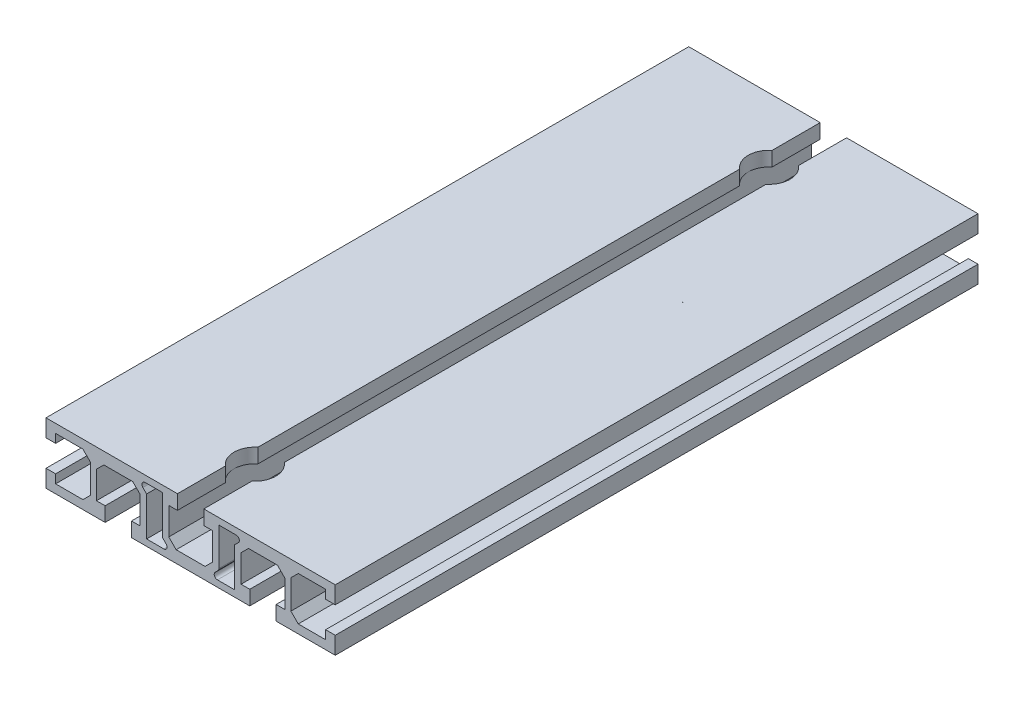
ISO-10303-21;
HEADER;
FILE_DESCRIPTION(('STEP AP214'),'2;1');
FILE_NAME('part.step','',(''),(''),'','','');
FILE_SCHEMA(('AUTOMOTIVE_DESIGN { 1 0 10303 214 1 1 1 1 }'));
ENDSEC;
DATA;
#1=APPLICATION_CONTEXT('core data for automotive mechanical design processes');
#2=APPLICATION_PROTOCOL_DEFINITION('international standard','automotive_design',2000,#1);
#3=PRODUCT_CONTEXT('',#1,'mechanical');
#4=PRODUCT('Part','Part','',(#3));
#5=PRODUCT_RELATED_PRODUCT_CATEGORY('part','',(#4));
#6=PRODUCT_DEFINITION_FORMATION('','',#4);
#7=PRODUCT_DEFINITION_CONTEXT('part definition',#1,'design');
#8=PRODUCT_DEFINITION('design','',#6,#7);
#9=PRODUCT_DEFINITION_SHAPE('','',#8);
#10=(LENGTH_UNIT() NAMED_UNIT(*) SI_UNIT(.MILLI.,.METRE.));
#11=(NAMED_UNIT(*) PLANE_ANGLE_UNIT() SI_UNIT($,.RADIAN.));
#12=(NAMED_UNIT(*) SI_UNIT($,.STERADIAN.) SOLID_ANGLE_UNIT());
#13=UNCERTAINTY_MEASURE_WITH_UNIT(LENGTH_MEASURE(1.E-05),#10,'distance_accuracy_value','');
#14=(GEOMETRIC_REPRESENTATION_CONTEXT(3) GLOBAL_UNCERTAINTY_ASSIGNED_CONTEXT((#13)) GLOBAL_UNIT_ASSIGNED_CONTEXT((#10,
#11,#12)) REPRESENTATION_CONTEXT('',''));
#15=CARTESIAN_POINT('',(0.,0.,0.));
#16=DIRECTION('',(0.,0.,1.));
#17=DIRECTION('',(1.,0.,0.));
#18=AXIS2_PLACEMENT_3D('',#15,#16,#17);
#19=CARTESIAN_POINT('',(-4.09999999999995,4.99999999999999,-100.));
#20=DIRECTION('',(1.,0.,0.));
#21=DIRECTION('',(0.,1.,0.));
#22=AXIS2_PLACEMENT_3D('',#19,#20,#21);
#23=PLANE('',#22);
#24=DIRECTION('',(0.,-1.,0.));
#25=VECTOR('',#24,1.);
#26=CARTESIAN_POINT('',(-4.1000000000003,90.5,85.0438080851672));
#27=LINE('',#26,#25);
#28=CARTESIAN_POINT('',(-4.10000000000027,9.50000000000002,85.0438080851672));
#29=VERTEX_POINT('',#28);
#30=CARTESIAN_POINT('',(-4.09999999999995,4.99999999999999,85.0438080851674));
#31=VERTEX_POINT('',#30);
#32=EDGE_CURVE('E47',#29,#31,#27,.T.);
#33=ORIENTED_EDGE('',*,*,#32,.F.);
#34=DIRECTION('',(0.,0.,1.));
#35=VECTOR('',#34,1.);
#36=CARTESIAN_POINT('',(-4.09999999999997,9.50000000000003,-100.));
#37=LINE('',#36,#35);
#38=CARTESIAN_POINT('',(-4.09999999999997,9.50000000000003,100.));
#39=VERTEX_POINT('',#38);
#40=EDGE_CURVE('E682',#29,#39,#37,.T.);
#41=ORIENTED_EDGE('',*,*,#40,.T.);
#42=DIRECTION('',(0.,1.,0.));
#43=VECTOR('',#42,1.);
#44=CARTESIAN_POINT('',(-4.09999999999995,4.99999999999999,100.));
#45=LINE('',#44,#43);
#46=CARTESIAN_POINT('',(-4.09999999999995,4.99999999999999,100.));
#47=VERTEX_POINT('',#46);
#48=EDGE_CURVE('E751',#47,#39,#45,.T.);
#49=ORIENTED_EDGE('',*,*,#48,.F.);
#50=DIRECTION('',(0.,0.,1.));
#51=VECTOR('',#50,1.);
#52=CARTESIAN_POINT('',(-4.09999999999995,4.99999999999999,-100.));
#53=LINE('',#52,#51);
#54=EDGE_CURVE('E687',#31,#47,#53,.T.);
#55=ORIENTED_EDGE('',*,*,#54,.F.);
#56=EDGE_LOOP('',(#33,#41,#49,#55));
#57=FACE_BOUND('',#56,.T.);
#58=ADVANCED_FACE('F30',(#57),#23,.T.);
#59=CARTESIAN_POINT('',(4.50000000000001,-5.79999999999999,-100.));
#60=DIRECTION('',(0.,1.,0.));
#61=DIRECTION('',(-1.,0.,0.));
#62=AXIS2_PLACEMENT_3D('',#59,#60,#61);
#63=PLANE('',#62);
#64=CARTESIAN_POINT('',(0.,-5.79999999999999,80.));
#65=DIRECTION('',(0.,1.,0.));
#66=DIRECTION('',(-1.,0.,0.));
#67=AXIS2_PLACEMENT_3D('',#64,#65,#66);
#68=CIRCLE('',#67,6.5);
#69=CARTESIAN_POINT('',(-4.50000000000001,-5.79999999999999,84.6904157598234));
#70=VERTEX_POINT('',#69);
#71=CARTESIAN_POINT('',(4.50000000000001,-5.79999999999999,84.6904157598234));
#72=VERTEX_POINT('',#71);
#73=EDGE_CURVE('E55',#70,#72,#68,.T.);
#74=ORIENTED_EDGE('',*,*,#73,.F.);
#75=DIRECTION('',(0.,0.,1.));
#76=VECTOR('',#75,1.);
#77=CARTESIAN_POINT('',(-4.50000000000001,-5.79999999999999,-100.));
#78=LINE('',#77,#76);
#79=CARTESIAN_POINT('',(-4.50000000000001,-5.79999999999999,100.));
#80=VERTEX_POINT('',#79);
#81=EDGE_CURVE('E696',#70,#80,#78,.T.);
#82=ORIENTED_EDGE('',*,*,#81,.T.);
#83=DIRECTION('',(-1.,0.,0.));
#84=VECTOR('',#83,1.);
#85=CARTESIAN_POINT('',(4.50000000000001,-5.79999999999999,100.));
#86=LINE('',#85,#84);
#87=CARTESIAN_POINT('',(4.50000000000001,-5.79999999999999,100.));
#88=VERTEX_POINT('',#87);
#89=EDGE_CURVE('E739',#88,#80,#86,.T.);
#90=ORIENTED_EDGE('',*,*,#89,.F.);
#91=DIRECTION('',(0.,0.,1.));
#92=VECTOR('',#91,1.);
#93=CARTESIAN_POINT('',(4.50000000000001,-5.79999999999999,-100.));
#94=LINE('',#93,#92);
#95=EDGE_CURVE('E701',#72,#88,#94,.T.);
#96=ORIENTED_EDGE('',*,*,#95,.F.);
#97=EDGE_LOOP('',(#74,#82,#90,#96));
#98=FACE_BOUND('',#97,.T.);
#99=ADVANCED_FACE('F1161',(#98),#63,.T.);
#100=CARTESIAN_POINT('',(4.10000000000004,9.5,-100.));
#101=DIRECTION('',(-1.,0.,0.));
#102=DIRECTION('',(0.,-1.,0.));
#103=AXIS2_PLACEMENT_3D('',#100,#101,#102);
#104=PLANE('',#103);
#105=DIRECTION('',(0.,-1.,0.));
#106=VECTOR('',#105,1.);
#107=CARTESIAN_POINT('',(4.10000000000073,90.5,74.9561919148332));
#108=LINE('',#107,#106);
#109=CARTESIAN_POINT('',(4.10000000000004,9.49999999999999,74.9561919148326));
#110=VERTEX_POINT('',#109);
#111=CARTESIAN_POINT('',(4.10000000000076,5.,74.9561919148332));
#112=VERTEX_POINT('',#111);
#113=EDGE_CURVE('E548',#110,#112,#108,.T.);
#114=ORIENTED_EDGE('',*,*,#113,.F.);
#115=DIRECTION('',(0.,0.,1.));
#116=VECTOR('',#115,1.);
#117=CARTESIAN_POINT('',(4.10000000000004,9.5,-100.));
#118=LINE('',#117,#116);
#119=CARTESIAN_POINT('',(4.10000000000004,9.49999999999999,-74.9561919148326));
#120=VERTEX_POINT('',#119);
#121=EDGE_CURVE('E562',#120,#110,#118,.T.);
#122=ORIENTED_EDGE('',*,*,#121,.F.);
#123=DIRECTION('',(0.,-1.,0.));
#124=VECTOR('',#123,1.);
#125=CARTESIAN_POINT('',(4.10000000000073,90.5,-74.9561919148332));
#126=LINE('',#125,#124);
#127=CARTESIAN_POINT('',(4.10000000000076,5.,-74.9561919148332));
#128=VERTEX_POINT('',#127);
#129=EDGE_CURVE('E1190',#128,#120,#126,.F.);
#130=ORIENTED_EDGE('',*,*,#129,.F.);
#131=DIRECTION('',(0.,0.,1.));
#132=VECTOR('',#131,1.);
#133=CARTESIAN_POINT('',(4.1,5.,-100.));
#134=LINE('',#133,#132);
#135=EDGE_CURVE('E564',#128,#112,#134,.T.);
#136=ORIENTED_EDGE('',*,*,#135,.T.);
#137=EDGE_LOOP('',(#114,#122,#130,#136));
#138=FACE_BOUND('',#137,.T.);
#139=ADVANCED_FACE('F560',(#138),#104,.T.);
#140=DIRECTION('',(0.,-1.,0.));
#141=VECTOR('',#140,1.);
#142=CARTESIAN_POINT('',(-4.1000000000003,90.5,74.9561919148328));
#143=LINE('',#142,#141);
#144=CARTESIAN_POINT('',(-4.09999999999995,4.99999999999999,74.9561919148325));
#145=VERTEX_POINT('',#144);
#146=CARTESIAN_POINT('',(-4.10000000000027,9.50000000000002,74.9561919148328));
#147=VERTEX_POINT('',#146);
#148=EDGE_CURVE('E1177',#145,#147,#143,.F.);
#149=ORIENTED_EDGE('',*,*,#148,.F.);
#150=CARTESIAN_POINT('',(-4.09999999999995,4.99999999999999,-74.9561919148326));
#151=VERTEX_POINT('',#150);
#152=EDGE_CURVE('E686',#151,#145,#53,.T.);
#153=ORIENTED_EDGE('',*,*,#152,.F.);
#154=DIRECTION('',(0.,-1.,0.));
#155=VECTOR('',#154,1.);
#156=CARTESIAN_POINT('',(-4.1000000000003,90.5,-74.9561919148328));
#157=LINE('',#156,#155);
#158=CARTESIAN_POINT('',(-4.10000000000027,9.50000000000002,-74.9561919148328));
#159=VERTEX_POINT('',#158);
#160=EDGE_CURVE('E1203',#159,#151,#157,.T.);
#161=ORIENTED_EDGE('',*,*,#160,.F.);
#162=EDGE_CURVE('E681',#159,#147,#37,.T.);
#163=ORIENTED_EDGE('',*,*,#162,.T.);
#164=EDGE_LOOP('',(#149,#153,#161,#163));
#165=FACE_BOUND('',#164,.T.);
#166=ADVANCED_FACE('F1423',(#165),#23,.T.);
#167=CARTESIAN_POINT('',(4.50000000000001,-5.79999999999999,75.3095842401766));
#168=VERTEX_POINT('',#167);
#169=CARTESIAN_POINT('',(-4.50000000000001,-5.79999999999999,75.3095842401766));
#170=VERTEX_POINT('',#169);
#171=EDGE_CURVE('E1169',#168,#170,#68,.T.);
#172=ORIENTED_EDGE('',*,*,#171,.F.);
#173=CARTESIAN_POINT('',(4.50000000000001,-5.79999999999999,-75.3095842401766));
#174=VERTEX_POINT('',#173);
#175=EDGE_CURVE('E700',#174,#168,#94,.T.);
#176=ORIENTED_EDGE('',*,*,#175,.F.);
#177=CARTESIAN_POINT('',(0.,-5.79999999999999,-80.));
#178=DIRECTION('',(0.,1.,0.));
#179=DIRECTION('',(-1.,0.,0.));
#180=AXIS2_PLACEMENT_3D('',#177,#178,#179);
#181=CIRCLE('',#180,6.5);
#182=CARTESIAN_POINT('',(-4.50000000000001,-5.79999999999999,-75.3095842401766));
#183=VERTEX_POINT('',#182);
#184=EDGE_CURVE('E1171',#183,#174,#181,.T.);
#185=ORIENTED_EDGE('',*,*,#184,.F.);
#186=EDGE_CURVE('E695',#183,#170,#78,.T.);
#187=ORIENTED_EDGE('',*,*,#186,.T.);
#188=EDGE_LOOP('',(#172,#176,#185,#187));
#189=FACE_BOUND('',#188,.T.);
#190=ADVANCED_FACE('F1167',(#189),#63,.T.);
#191=DIRECTION('',(0.,-1.,0.));
#192=VECTOR('',#191,1.);
#193=CARTESIAN_POINT('',(4.10000000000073,90.5,-85.0438080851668));
#194=LINE('',#193,#192);
#195=CARTESIAN_POINT('',(4.10000000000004,9.49999999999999,-85.0438080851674));
#196=VERTEX_POINT('',#195);
#197=CARTESIAN_POINT('',(4.10000000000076,5.,-85.0438080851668));
#198=VERTEX_POINT('',#197);
#199=EDGE_CURVE('E1192',#196,#198,#194,.T.);
#200=ORIENTED_EDGE('',*,*,#199,.F.);
#201=CARTESIAN_POINT('',(4.10000000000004,9.5,-100.));
#202=VERTEX_POINT('',#201);
#203=EDGE_CURVE('E571',#202,#196,#118,.T.);
#204=ORIENTED_EDGE('',*,*,#203,.F.);
#205=DIRECTION('',(0.,-1.,0.));
#206=VECTOR('',#205,1.);
#207=CARTESIAN_POINT('',(4.10000000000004,9.5,-100.));
#208=LINE('',#207,#206);
#209=CARTESIAN_POINT('',(4.1,5.,-100.));
#210=VERTEX_POINT('',#209);
#211=EDGE_CURVE('E972',#202,#210,#208,.T.);
#212=ORIENTED_EDGE('',*,*,#211,.T.);
#213=EDGE_CURVE('E578',#210,#198,#134,.T.);
#214=ORIENTED_EDGE('',*,*,#213,.T.);
#215=EDGE_LOOP('',(#200,#204,#212,#214));
#216=FACE_BOUND('',#215,.T.);
#217=ADVANCED_FACE('F1595',(#216),#104,.T.);
#218=CARTESIAN_POINT('',(-18.4,-5.,-100.));
#219=DIRECTION('',(-1.,0.,0.));
#220=DIRECTION('',(0.,-1.,0.));
#221=AXIS2_PLACEMENT_3D('',#218,#219,#220);
#222=PLANE('',#221);
#223=DIRECTION('',(0.,0.,1.));
#224=VECTOR('',#223,1.);
#225=CARTESIAN_POINT('',(-18.4,-9.50000000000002,-100.));
#226=LINE('',#225,#224);
#227=CARTESIAN_POINT('',(-18.4,-9.50000000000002,-100.));
#228=VERTEX_POINT('',#227);
#229=CARTESIAN_POINT('',(-18.4,-9.50000000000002,100.));
#230=VERTEX_POINT('',#229);
#231=EDGE_CURVE('E34',#228,#230,#226,.T.);
#232=ORIENTED_EDGE('',*,*,#231,.T.);
#233=DIRECTION('',(0.,-1.,0.));
#234=VECTOR('',#233,1.);
#235=CARTESIAN_POINT('',(-18.4,-5.,100.));
#236=LINE('',#235,#234);
#237=CARTESIAN_POINT('',(-18.4,-5.,100.));
#238=VERTEX_POINT('',#237);
#239=EDGE_CURVE('E1258',#238,#230,#236,.T.);
#240=ORIENTED_EDGE('',*,*,#239,.F.);
#241=DIRECTION('',(0.,0.,1.));
#242=VECTOR('',#241,1.);
#243=CARTESIAN_POINT('',(-18.4,-5.,-100.));
#244=LINE('',#243,#242);
#245=CARTESIAN_POINT('',(-18.4,-5.,-100.));
#246=VERTEX_POINT('',#245);
#247=EDGE_CURVE('E11',#246,#238,#244,.T.);
#248=ORIENTED_EDGE('',*,*,#247,.F.);
#249=DIRECTION('',(0.,-1.,0.));
#250=VECTOR('',#249,1.);
#251=CARTESIAN_POINT('',(-18.4,-5.,-100.));
#252=LINE('',#251,#250);
#253=EDGE_CURVE('E889',#246,#228,#252,.T.);
#254=ORIENTED_EDGE('',*,*,#253,.T.);
#255=EDGE_LOOP('',(#232,#240,#248,#254));
#256=FACE_BOUND('',#255,.T.);
#257=ADVANCED_FACE('F32',(#256),#222,.T.);
#258=CARTESIAN_POINT('',(-15.7,-5.,-100.));
#259=DIRECTION('',(0.,1.,0.));
#260=DIRECTION('',(-1.,0.,0.));
#261=AXIS2_PLACEMENT_3D('',#258,#259,#260);
#262=PLANE('',#261);
#263=ORIENTED_EDGE('',*,*,#247,.T.);
#264=DIRECTION('',(-1.,0.,0.));
#265=VECTOR('',#264,1.);
#266=CARTESIAN_POINT('',(-15.7,-5.,100.));
#267=LINE('',#266,#265);
#268=CARTESIAN_POINT('',(-15.7,-5.,100.));
#269=VERTEX_POINT('',#268);
#270=EDGE_CURVE('E814',#269,#238,#267,.T.);
#271=ORIENTED_EDGE('',*,*,#270,.F.);
#272=DIRECTION('',(0.,0.,1.));
#273=VECTOR('',#272,1.);
#274=CARTESIAN_POINT('',(-15.7,-5.,-100.));
#275=LINE('',#274,#273);
#276=CARTESIAN_POINT('',(-15.7,-5.,-100.));
#277=VERTEX_POINT('',#276);
#278=EDGE_CURVE('E39',#277,#269,#275,.T.);
#279=ORIENTED_EDGE('',*,*,#278,.F.);
#280=DIRECTION('',(-1.,0.,0.));
#281=VECTOR('',#280,1.);
#282=CARTESIAN_POINT('',(-15.7,-5.,-100.));
#283=LINE('',#282,#281);
#284=EDGE_CURVE('E625',#277,#246,#283,.T.);
#285=ORIENTED_EDGE('',*,*,#284,.T.);
#286=EDGE_LOOP('',(#263,#271,#279,#285));
#287=FACE_BOUND('',#286,.T.);
#288=ADVANCED_FACE('F1480',(#287),#262,.T.);
#289=CARTESIAN_POINT('',(-15.7,3.5,-100.));
#290=DIRECTION('',(-1.,0.,0.));
#291=DIRECTION('',(0.,-1.,0.));
#292=AXIS2_PLACEMENT_3D('',#289,#290,#291);
#293=PLANE('',#292);
#294=ORIENTED_EDGE('',*,*,#278,.T.);
#295=DIRECTION('',(0.,-1.,0.));
#296=VECTOR('',#295,1.);
#297=CARTESIAN_POINT('',(-15.7,3.5,100.));
#298=LINE('',#297,#296);
#299=CARTESIAN_POINT('',(-15.7,3.5,100.));
#300=VERTEX_POINT('',#299);
#301=EDGE_CURVE('E811',#300,#269,#298,.T.);
#302=ORIENTED_EDGE('',*,*,#301,.F.);
#303=DIRECTION('',(0.,0.,1.));
#304=VECTOR('',#303,1.);
#305=CARTESIAN_POINT('',(-15.7,3.5,-100.));
#306=LINE('',#305,#304);
#307=CARTESIAN_POINT('',(-15.7,3.5,-100.));
#308=VERTEX_POINT('',#307);
#309=EDGE_CURVE('E640',#308,#300,#306,.T.);
#310=ORIENTED_EDGE('',*,*,#309,.F.);
#311=DIRECTION('',(0.,-1.,0.));
#312=VECTOR('',#311,1.);
#313=CARTESIAN_POINT('',(-15.7,3.5,-100.));
#314=LINE('',#313,#312);
#315=EDGE_CURVE('E630',#308,#277,#314,.T.);
#316=ORIENTED_EDGE('',*,*,#315,.T.);
#317=EDGE_LOOP('',(#294,#302,#310,#316));
#318=FACE_BOUND('',#317,.T.);
#319=ADVANCED_FACE('F1477',(#318),#293,.T.);
#320=CARTESIAN_POINT('',(-18.,5.79999999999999,-100.));
#321=DIRECTION('',(-0.707106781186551,-0.707106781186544,0.));
#322=DIRECTION('',(0.707106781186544,-0.707106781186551,0.));
#323=AXIS2_PLACEMENT_3D('',#320,#321,#322);
#324=PLANE('',#323);
#325=ORIENTED_EDGE('',*,*,#309,.T.);
#326=DIRECTION('',(0.707106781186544,-0.707106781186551,0.));
#327=VECTOR('',#326,1.);
#328=CARTESIAN_POINT('',(-18.,5.79999999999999,100.));
#329=LINE('',#328,#327);
#330=CARTESIAN_POINT('',(-18.,5.79999999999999,100.));
#331=VERTEX_POINT('',#330);
#332=EDGE_CURVE('E808',#331,#300,#329,.T.);
#333=ORIENTED_EDGE('',*,*,#332,.F.);
#334=DIRECTION('',(0.,0.,1.));
#335=VECTOR('',#334,1.);
#336=CARTESIAN_POINT('',(-18.,5.79999999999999,-100.));
#337=LINE('',#336,#335);
#338=CARTESIAN_POINT('',(-18.,5.79999999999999,-100.));
#339=VERTEX_POINT('',#338);
#340=EDGE_CURVE('E642',#339,#331,#337,.T.);
#341=ORIENTED_EDGE('',*,*,#340,.F.);
#342=DIRECTION('',(0.707106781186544,-0.707106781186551,0.));
#343=VECTOR('',#342,1.);
#344=CARTESIAN_POINT('',(-18.,5.79999999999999,-100.));
#345=LINE('',#344,#343);
#346=EDGE_CURVE('E635',#339,#308,#345,.T.);
#347=ORIENTED_EDGE('',*,*,#346,.T.);
#348=EDGE_LOOP('',(#325,#333,#341,#347));
#349=FACE_BOUND('',#348,.T.);
#350=ADVANCED_FACE('F1053',(#349),#324,.T.);
#351=CARTESIAN_POINT('',(-27.,5.79999999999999,-100.));
#352=DIRECTION('',(0.,-1.,0.));
#353=DIRECTION('',(1.,0.,0.));
#354=AXIS2_PLACEMENT_3D('',#351,#352,#353);
#355=PLANE('',#354);
#356=ORIENTED_EDGE('',*,*,#340,.T.);
#357=DIRECTION('',(1.,0.,0.));
#358=VECTOR('',#357,1.);
#359=CARTESIAN_POINT('',(-27.,5.79999999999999,100.));
#360=LINE('',#359,#358);
#361=CARTESIAN_POINT('',(-27.,5.79999999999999,100.));
#362=VERTEX_POINT('',#361);
#363=EDGE_CURVE('E805',#362,#331,#360,.T.);
#364=ORIENTED_EDGE('',*,*,#363,.F.);
#365=DIRECTION('',(0.,0.,1.));
#366=VECTOR('',#365,1.);
#367=CARTESIAN_POINT('',(-27.,5.79999999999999,-100.));
#368=LINE('',#367,#366);
#369=CARTESIAN_POINT('',(-27.,5.79999999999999,-100.));
#370=VERTEX_POINT('',#369);
#371=EDGE_CURVE('E644',#370,#362,#368,.T.);
#372=ORIENTED_EDGE('',*,*,#371,.F.);
#373=DIRECTION('',(1.,0.,0.));
#374=VECTOR('',#373,1.);
#375=CARTESIAN_POINT('',(-27.,5.79999999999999,-100.));
#376=LINE('',#375,#374);
#377=EDGE_CURVE('E1048',#370,#339,#376,.T.);
#378=ORIENTED_EDGE('',*,*,#377,.T.);
#379=EDGE_LOOP('',(#356,#364,#372,#378));
#380=FACE_BOUND('',#379,.T.);
#381=ADVANCED_FACE('F1062',(#380),#355,.T.);
#382=CARTESIAN_POINT('',(-29.3,3.50000000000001,-100.));
#383=DIRECTION('',(0.707106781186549,-0.707106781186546,0.));
#384=DIRECTION('',(0.707106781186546,0.707106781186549,0.));
#385=AXIS2_PLACEMENT_3D('',#382,#383,#384);
#386=PLANE('',#385);
#387=ORIENTED_EDGE('',*,*,#371,.T.);
#388=DIRECTION('',(0.707106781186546,0.707106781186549,0.));
#389=VECTOR('',#388,1.);
#390=CARTESIAN_POINT('',(-29.3,3.50000000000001,100.));
#391=LINE('',#390,#389);
#392=CARTESIAN_POINT('',(-29.3,3.50000000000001,100.));
#393=VERTEX_POINT('',#392);
#394=EDGE_CURVE('E802',#393,#362,#391,.T.);
#395=ORIENTED_EDGE('',*,*,#394,.F.);
#396=DIRECTION('',(0.,0.,1.));
#397=VECTOR('',#396,1.);
#398=CARTESIAN_POINT('',(-29.3,3.50000000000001,-100.));
#399=LINE('',#398,#397);
#400=CARTESIAN_POINT('',(-29.3,3.50000000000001,-100.));
#401=VERTEX_POINT('',#400);
#402=EDGE_CURVE('E646',#401,#393,#399,.T.);
#403=ORIENTED_EDGE('',*,*,#402,.F.);
#404=DIRECTION('',(0.707106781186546,0.707106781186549,0.));
#405=VECTOR('',#404,1.);
#406=CARTESIAN_POINT('',(-29.3,3.50000000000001,-100.));
#407=LINE('',#406,#405);
#408=EDGE_CURVE('E1045',#401,#370,#407,.T.);
#409=ORIENTED_EDGE('',*,*,#408,.T.);
#410=EDGE_LOOP('',(#387,#395,#403,#409));
#411=FACE_BOUND('',#410,.T.);
#412=ADVANCED_FACE('F1066',(#411),#386,.T.);
#413=CARTESIAN_POINT('',(-29.2999999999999,-5.00000000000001,-100.));
#414=DIRECTION('',(1.,0.,0.));
#415=DIRECTION('',(0.,1.,0.));
#416=AXIS2_PLACEMENT_3D('',#413,#414,#415);
#417=PLANE('',#416);
#418=ORIENTED_EDGE('',*,*,#402,.T.);
#419=DIRECTION('',(0.,1.,0.));
#420=VECTOR('',#419,1.);
#421=CARTESIAN_POINT('',(-29.2999999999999,-5.00000000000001,100.));
#422=LINE('',#421,#420);
#423=CARTESIAN_POINT('',(-29.2999999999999,-5.00000000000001,100.));
#424=VERTEX_POINT('',#423);
#425=EDGE_CURVE('E799',#424,#393,#422,.T.);
#426=ORIENTED_EDGE('',*,*,#425,.F.);
#427=DIRECTION('',(0.,0.,1.));
#428=VECTOR('',#427,1.);
#429=CARTESIAN_POINT('',(-29.2999999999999,-5.00000000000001,-100.));
#430=LINE('',#429,#428);
#431=CARTESIAN_POINT('',(-29.2999999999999,-5.00000000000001,-100.));
#432=VERTEX_POINT('',#431);
#433=EDGE_CURVE('E648',#432,#424,#430,.T.);
#434=ORIENTED_EDGE('',*,*,#433,.F.);
#435=DIRECTION('',(0.,1.,0.));
#436=VECTOR('',#435,1.);
#437=CARTESIAN_POINT('',(-29.2999999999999,-5.00000000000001,-100.));
#438=LINE('',#437,#436);
#439=EDGE_CURVE('E1042',#432,#401,#438,.T.);
#440=ORIENTED_EDGE('',*,*,#439,.T.);
#441=EDGE_LOOP('',(#418,#426,#434,#440));
#442=FACE_BOUND('',#441,.T.);
#443=ADVANCED_FACE('F1070',(#442),#417,.T.);
#444=CARTESIAN_POINT('',(-26.6,-5.,-100.));
#445=DIRECTION('',(0.,1.,0.));
#446=DIRECTION('',(-1.,0.,0.));
#447=AXIS2_PLACEMENT_3D('',#444,#445,#446);
#448=PLANE('',#447);
#449=ORIENTED_EDGE('',*,*,#433,.T.);
#450=DIRECTION('',(-1.,0.,0.));
#451=VECTOR('',#450,1.);
#452=CARTESIAN_POINT('',(-26.6,-5.,100.));
#453=LINE('',#452,#451);
#454=CARTESIAN_POINT('',(-26.6,-5.,100.));
#455=VERTEX_POINT('',#454);
#456=EDGE_CURVE('E796',#455,#424,#453,.T.);
#457=ORIENTED_EDGE('',*,*,#456,.F.);
#458=DIRECTION('',(0.,0.,1.));
#459=VECTOR('',#458,1.);
#460=CARTESIAN_POINT('',(-26.6,-5.,-100.));
#461=LINE('',#460,#459);
#462=CARTESIAN_POINT('',(-26.6,-5.,-100.));
#463=VERTEX_POINT('',#462);
#464=EDGE_CURVE('E650',#463,#455,#461,.T.);
#465=ORIENTED_EDGE('',*,*,#464,.F.);
#466=DIRECTION('',(-1.,0.,0.));
#467=VECTOR('',#466,1.);
#468=CARTESIAN_POINT('',(-26.6,-5.,-100.));
#469=LINE('',#468,#467);
#470=EDGE_CURVE('E1039',#463,#432,#469,.T.);
#471=ORIENTED_EDGE('',*,*,#470,.T.);
#472=EDGE_LOOP('',(#449,#457,#465,#471));
#473=FACE_BOUND('',#472,.T.);
#474=ADVANCED_FACE('F1075',(#473),#448,.T.);
#475=CARTESIAN_POINT('',(-26.5999999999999,-9.50000000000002,-100.));
#476=DIRECTION('',(1.,0.,0.));
#477=DIRECTION('',(0.,1.,0.));
#478=AXIS2_PLACEMENT_3D('',#475,#476,#477);
#479=PLANE('',#478);
#480=ORIENTED_EDGE('',*,*,#464,.T.);
#481=DIRECTION('',(0.,1.,0.));
#482=VECTOR('',#481,1.);
#483=CARTESIAN_POINT('',(-26.5999999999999,-9.50000000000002,100.));
#484=LINE('',#483,#482);
#485=CARTESIAN_POINT('',(-26.5999999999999,-9.50000000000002,100.));
#486=VERTEX_POINT('',#485);
#487=EDGE_CURVE('E793',#486,#455,#484,.T.);
#488=ORIENTED_EDGE('',*,*,#487,.F.);
#489=DIRECTION('',(0.,0.,1.));
#490=VECTOR('',#489,1.);
#491=CARTESIAN_POINT('',(-26.5999999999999,-9.50000000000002,-100.));
#492=LINE('',#491,#490);
#493=CARTESIAN_POINT('',(-26.5999999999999,-9.50000000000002,-100.));
#494=VERTEX_POINT('',#493);
#495=EDGE_CURVE('E652',#494,#486,#492,.T.);
#496=ORIENTED_EDGE('',*,*,#495,.F.);
#497=DIRECTION('',(0.,1.,0.));
#498=VECTOR('',#497,1.);
#499=CARTESIAN_POINT('',(-26.5999999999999,-9.50000000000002,-100.));
#500=LINE('',#499,#498);
#501=EDGE_CURVE('E1036',#494,#463,#500,.T.);
#502=ORIENTED_EDGE('',*,*,#501,.T.);
#503=EDGE_LOOP('',(#480,#488,#496,#502));
#504=FACE_BOUND('',#503,.T.);
#505=ADVANCED_FACE('F1078',(#504),#479,.T.);
#506=CARTESIAN_POINT('',(-45.,-9.50000000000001,-100.));
#507=DIRECTION('',(0.,-1.,0.));
#508=DIRECTION('',(1.,0.,0.));
#509=AXIS2_PLACEMENT_3D('',#506,#507,#508);
#510=PLANE('',#509);
#511=ORIENTED_EDGE('',*,*,#495,.T.);
#512=DIRECTION('',(1.,0.,0.));
#513=VECTOR('',#512,1.);
#514=CARTESIAN_POINT('',(-45.,-9.50000000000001,100.));
#515=LINE('',#514,#513);
#516=CARTESIAN_POINT('',(-45.,-9.50000000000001,100.));
#517=VERTEX_POINT('',#516);
#518=EDGE_CURVE('E790',#517,#486,#515,.T.);
#519=ORIENTED_EDGE('',*,*,#518,.F.);
#520=DIRECTION('',(0.,0.,1.));
#521=VECTOR('',#520,1.);
#522=CARTESIAN_POINT('',(-45.,-9.50000000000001,-100.));
#523=LINE('',#522,#521);
#524=CARTESIAN_POINT('',(-45.,-9.50000000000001,-100.));
#525=VERTEX_POINT('',#524);
#526=EDGE_CURVE('E654',#525,#517,#523,.T.);
#527=ORIENTED_EDGE('',*,*,#526,.F.);
#528=DIRECTION('',(1.,0.,0.));
#529=VECTOR('',#528,1.);
#530=CARTESIAN_POINT('',(-45.,-9.50000000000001,-100.));
#531=LINE('',#530,#529);
#532=EDGE_CURVE('E1033',#525,#494,#531,.T.);
#533=ORIENTED_EDGE('',*,*,#532,.T.);
#534=EDGE_LOOP('',(#511,#519,#527,#533));
#535=FACE_BOUND('',#534,.T.);
#536=ADVANCED_FACE('F1082',(#535),#510,.T.);
#537=CARTESIAN_POINT('',(-45.,-4.10000000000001,-100.));
#538=DIRECTION('',(-1.,0.,0.));
#539=DIRECTION('',(0.,-1.,0.));
#540=AXIS2_PLACEMENT_3D('',#537,#538,#539);
#541=PLANE('',#540);
#542=ORIENTED_EDGE('',*,*,#526,.T.);
#543=DIRECTION('',(0.,-1.,0.));
#544=VECTOR('',#543,1.);
#545=CARTESIAN_POINT('',(-45.,-4.10000000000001,100.));
#546=LINE('',#545,#544);
#547=CARTESIAN_POINT('',(-45.,-4.10000000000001,100.));
#548=VERTEX_POINT('',#547);
#549=EDGE_CURVE('E787',#548,#517,#546,.T.);
#550=ORIENTED_EDGE('',*,*,#549,.F.);
#551=DIRECTION('',(0.,0.,1.));
#552=VECTOR('',#551,1.);
#553=CARTESIAN_POINT('',(-45.,-4.10000000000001,-100.));
#554=LINE('',#553,#552);
#555=CARTESIAN_POINT('',(-45.,-4.10000000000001,-100.));
#556=VERTEX_POINT('',#555);
#557=EDGE_CURVE('E656',#556,#548,#554,.T.);
#558=ORIENTED_EDGE('',*,*,#557,.F.);
#559=DIRECTION('',(0.,-1.,0.));
#560=VECTOR('',#559,1.);
#561=CARTESIAN_POINT('',(-45.,-4.10000000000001,-100.));
#562=LINE('',#561,#560);
#563=EDGE_CURVE('E1030',#556,#525,#562,.T.);
#564=ORIENTED_EDGE('',*,*,#563,.T.);
#565=EDGE_LOOP('',(#542,#550,#558,#564));
#566=FACE_BOUND('',#565,.T.);
#567=ADVANCED_FACE('F1087',(#566),#541,.T.);
#568=CARTESIAN_POINT('',(-42.0000000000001,-4.10000000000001,-100.));
#569=DIRECTION('',(0.,1.,0.));
#570=DIRECTION('',(0.,0.,1.));
#571=AXIS2_PLACEMENT_3D('',#568,#569,#570);
#572=PLANE('',#571);
#573=ORIENTED_EDGE('',*,*,#557,.T.);
#574=DIRECTION('',(-1.,0.,0.));
#575=VECTOR('',#574,1.);
#576=CARTESIAN_POINT('',(-42.0000000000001,-4.10000000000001,100.));
#577=LINE('',#576,#575);
#578=CARTESIAN_POINT('',(-42.0000000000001,-4.10000000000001,100.));
#579=VERTEX_POINT('',#578);
#580=EDGE_CURVE('E784',#579,#548,#577,.T.);
#581=ORIENTED_EDGE('',*,*,#580,.F.);
#582=DIRECTION('',(0.,0.,1.));
#583=VECTOR('',#582,1.);
#584=CARTESIAN_POINT('',(-42.0000000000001,-4.10000000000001,-100.));
#585=LINE('',#584,#583);
#586=CARTESIAN_POINT('',(-42.0000000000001,-4.10000000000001,-100.));
#587=VERTEX_POINT('',#586);
#588=EDGE_CURVE('E658',#587,#579,#585,.T.);
#589=ORIENTED_EDGE('',*,*,#588,.F.);
#590=DIRECTION('',(-1.,0.,0.));
#591=VECTOR('',#590,1.);
#592=CARTESIAN_POINT('',(-42.0000000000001,-4.10000000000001,-100.));
#593=LINE('',#592,#591);
#594=EDGE_CURVE('E1027',#587,#556,#593,.T.);
#595=ORIENTED_EDGE('',*,*,#594,.T.);
#596=EDGE_LOOP('',(#573,#581,#589,#595));
#597=FACE_BOUND('',#596,.T.);
#598=ADVANCED_FACE('F1090',(#597),#572,.T.);
#599=CARTESIAN_POINT('',(-42.0000000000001,-6.79999999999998,-100.));
#600=DIRECTION('',(1.,0.,0.));
#601=DIRECTION('',(0.,1.,0.));
#602=AXIS2_PLACEMENT_3D('',#599,#600,#601);
#603=PLANE('',#602);
#604=ORIENTED_EDGE('',*,*,#588,.T.);
#605=DIRECTION('',(0.,1.,0.));
#606=VECTOR('',#605,1.);
#607=CARTESIAN_POINT('',(-42.0000000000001,-6.79999999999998,100.));
#608=LINE('',#607,#606);
#609=CARTESIAN_POINT('',(-42.0000000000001,-6.79999999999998,100.));
#610=VERTEX_POINT('',#609);
#611=EDGE_CURVE('E781',#610,#579,#608,.T.);
#612=ORIENTED_EDGE('',*,*,#611,.F.);
#613=DIRECTION('',(0.,0.,1.));
#614=VECTOR('',#613,1.);
#615=CARTESIAN_POINT('',(-42.0000000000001,-6.79999999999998,-100.));
#616=LINE('',#615,#614);
#617=CARTESIAN_POINT('',(-42.0000000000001,-6.79999999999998,-100.));
#618=VERTEX_POINT('',#617);
#619=EDGE_CURVE('E660',#618,#610,#616,.T.);
#620=ORIENTED_EDGE('',*,*,#619,.F.);
#621=DIRECTION('',(0.,1.,0.));
#622=VECTOR('',#621,1.);
#623=CARTESIAN_POINT('',(-42.0000000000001,-6.79999999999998,-100.));
#624=LINE('',#623,#622);
#625=EDGE_CURVE('E1024',#618,#587,#624,.T.);
#626=ORIENTED_EDGE('',*,*,#625,.T.);
#627=EDGE_LOOP('',(#604,#612,#620,#626));
#628=FACE_BOUND('',#627,.T.);
#629=ADVANCED_FACE('F1094',(#628),#603,.T.);
#630=CARTESIAN_POINT('',(-33.5,-6.8,-100.));
#631=DIRECTION('',(0.,1.,0.));
#632=DIRECTION('',(-1.,0.,0.));
#633=AXIS2_PLACEMENT_3D('',#630,#631,#632);
#634=PLANE('',#633);
#635=ORIENTED_EDGE('',*,*,#619,.T.);
#636=DIRECTION('',(-1.,0.,0.));
#637=VECTOR('',#636,1.);
#638=CARTESIAN_POINT('',(-33.5,-6.8,100.));
#639=LINE('',#638,#637);
#640=CARTESIAN_POINT('',(-33.5,-6.8,100.));
#641=VERTEX_POINT('',#640);
#642=EDGE_CURVE('E778',#641,#610,#639,.T.);
#643=ORIENTED_EDGE('',*,*,#642,.F.);
#644=DIRECTION('',(0.,0.,1.));
#645=VECTOR('',#644,1.);
#646=CARTESIAN_POINT('',(-33.5,-6.8,-100.));
#647=LINE('',#646,#645);
#648=CARTESIAN_POINT('',(-33.5,-6.8,-100.));
#649=VERTEX_POINT('',#648);
#650=EDGE_CURVE('E662',#649,#641,#647,.T.);
#651=ORIENTED_EDGE('',*,*,#650,.F.);
#652=DIRECTION('',(-1.,0.,0.));
#653=VECTOR('',#652,1.);
#654=CARTESIAN_POINT('',(-33.5,-6.8,-100.));
#655=LINE('',#654,#653);
#656=EDGE_CURVE('E1021',#649,#618,#655,.T.);
#657=ORIENTED_EDGE('',*,*,#656,.T.);
#658=EDGE_LOOP('',(#635,#643,#651,#657));
#659=FACE_BOUND('',#658,.T.);
#660=ADVANCED_FACE('F1099',(#659),#634,.T.);
#661=CARTESIAN_POINT('',(-31.2,-4.50000000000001,-100.));
#662=DIRECTION('',(-0.707106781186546,0.707106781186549,0.));
#663=DIRECTION('',(-0.707106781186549,-0.707106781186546,0.));
#664=AXIS2_PLACEMENT_3D('',#661,#662,#663);
#665=PLANE('',#664);
#666=ORIENTED_EDGE('',*,*,#650,.T.);
#667=DIRECTION('',(-0.707106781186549,-0.707106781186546,0.));
#668=VECTOR('',#667,1.);
#669=CARTESIAN_POINT('',(-31.2,-4.50000000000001,100.));
#670=LINE('',#669,#668);
#671=CARTESIAN_POINT('',(-31.2,-4.50000000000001,100.));
#672=VERTEX_POINT('',#671);
#673=EDGE_CURVE('E775',#672,#641,#670,.T.);
#674=ORIENTED_EDGE('',*,*,#673,.F.);
#675=DIRECTION('',(0.,0.,1.));
#676=VECTOR('',#675,1.);
#677=CARTESIAN_POINT('',(-31.2,-4.50000000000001,-100.));
#678=LINE('',#677,#676);
#679=CARTESIAN_POINT('',(-31.2,-4.50000000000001,-100.));
#680=VERTEX_POINT('',#679);
#681=EDGE_CURVE('E664',#680,#672,#678,.T.);
#682=ORIENTED_EDGE('',*,*,#681,.F.);
#683=DIRECTION('',(-0.707106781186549,-0.707106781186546,0.));
#684=VECTOR('',#683,1.);
#685=CARTESIAN_POINT('',(-31.2,-4.50000000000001,-100.));
#686=LINE('',#685,#684);
#687=EDGE_CURVE('E1018',#680,#649,#686,.T.);
#688=ORIENTED_EDGE('',*,*,#687,.T.);
#689=EDGE_LOOP('',(#666,#674,#682,#688));
#690=FACE_BOUND('',#689,.T.);
#691=ADVANCED_FACE('F1102',(#690),#665,.T.);
#692=CARTESIAN_POINT('',(-31.2,4.50000000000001,-100.));
#693=DIRECTION('',(-1.,0.,0.));
#694=DIRECTION('',(0.,0.,1.));
#695=AXIS2_PLACEMENT_3D('',#692,#693,#694);
#696=PLANE('',#695);
#697=ORIENTED_EDGE('',*,*,#681,.T.);
#698=DIRECTION('',(0.,-1.,0.));
#699=VECTOR('',#698,1.);
#700=CARTESIAN_POINT('',(-31.2,4.50000000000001,100.));
#701=LINE('',#700,#699);
#702=CARTESIAN_POINT('',(-31.2,4.50000000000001,100.));
#703=VERTEX_POINT('',#702);
#704=EDGE_CURVE('E772',#703,#672,#701,.T.);
#705=ORIENTED_EDGE('',*,*,#704,.F.);
#706=DIRECTION('',(0.,0.,1.));
#707=VECTOR('',#706,1.);
#708=CARTESIAN_POINT('',(-31.2,4.50000000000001,-100.));
#709=LINE('',#708,#707);
#710=CARTESIAN_POINT('',(-31.2,4.50000000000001,-100.));
#711=VERTEX_POINT('',#710);
#712=EDGE_CURVE('E666',#711,#703,#709,.T.);
#713=ORIENTED_EDGE('',*,*,#712,.F.);
#714=DIRECTION('',(0.,-1.,0.));
#715=VECTOR('',#714,1.);
#716=CARTESIAN_POINT('',(-31.2,4.50000000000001,-100.));
#717=LINE('',#716,#715);
#718=EDGE_CURVE('E1015',#711,#680,#717,.T.);
#719=ORIENTED_EDGE('',*,*,#718,.T.);
#720=EDGE_LOOP('',(#697,#705,#713,#719));
#721=FACE_BOUND('',#720,.T.);
#722=ADVANCED_FACE('F1106',(#721),#696,.T.);
#723=CARTESIAN_POINT('',(-33.5,6.8,-100.));
#724=DIRECTION('',(-0.707106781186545,-0.70710678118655,0.));
#725=DIRECTION('',(0.70710678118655,-0.707106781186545,0.));
#726=AXIS2_PLACEMENT_3D('',#723,#724,#725);
#727=PLANE('',#726);
#728=ORIENTED_EDGE('',*,*,#712,.T.);
#729=DIRECTION('',(0.70710678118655,-0.707106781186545,0.));
#730=VECTOR('',#729,1.);
#731=CARTESIAN_POINT('',(-33.5,6.8,100.));
#732=LINE('',#731,#730);
#733=CARTESIAN_POINT('',(-33.5,6.8,100.));
#734=VERTEX_POINT('',#733);
#735=EDGE_CURVE('E769',#734,#703,#732,.T.);
#736=ORIENTED_EDGE('',*,*,#735,.F.);
#737=DIRECTION('',(0.,0.,1.));
#738=VECTOR('',#737,1.);
#739=CARTESIAN_POINT('',(-33.5,6.8,-100.));
#740=LINE('',#739,#738);
#741=CARTESIAN_POINT('',(-33.5,6.8,-100.));
#742=VERTEX_POINT('',#741);
#743=EDGE_CURVE('E668',#742,#734,#740,.T.);
#744=ORIENTED_EDGE('',*,*,#743,.F.);
#745=DIRECTION('',(0.70710678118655,-0.707106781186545,0.));
#746=VECTOR('',#745,1.);
#747=CARTESIAN_POINT('',(-33.5,6.8,-100.));
#748=LINE('',#747,#746);
#749=EDGE_CURVE('E1012',#742,#711,#748,.T.);
#750=ORIENTED_EDGE('',*,*,#749,.T.);
#751=EDGE_LOOP('',(#728,#736,#744,#750));
#752=FACE_BOUND('',#751,.T.);
#753=ADVANCED_FACE('F1111',(#752),#727,.T.);
#754=CARTESIAN_POINT('',(-42.,6.79999999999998,-100.));
#755=DIRECTION('',(0.,-1.,0.));
#756=DIRECTION('',(1.,0.,0.));
#757=AXIS2_PLACEMENT_3D('',#754,#755,#756);
#758=PLANE('',#757);
#759=ORIENTED_EDGE('',*,*,#743,.T.);
#760=DIRECTION('',(1.,0.,0.));
#761=VECTOR('',#760,1.);
#762=CARTESIAN_POINT('',(-42.,6.79999999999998,100.));
#763=LINE('',#762,#761);
#764=CARTESIAN_POINT('',(-42.,6.79999999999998,100.));
#765=VERTEX_POINT('',#764);
#766=EDGE_CURVE('E766',#765,#734,#763,.T.);
#767=ORIENTED_EDGE('',*,*,#766,.F.);
#768=DIRECTION('',(0.,0.,1.));
#769=VECTOR('',#768,1.);
#770=CARTESIAN_POINT('',(-42.,6.79999999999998,-100.));
#771=LINE('',#770,#769);
#772=CARTESIAN_POINT('',(-42.,6.79999999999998,-100.));
#773=VERTEX_POINT('',#772);
#774=EDGE_CURVE('E670',#773,#765,#771,.T.);
#775=ORIENTED_EDGE('',*,*,#774,.F.);
#776=DIRECTION('',(1.,0.,0.));
#777=VECTOR('',#776,1.);
#778=CARTESIAN_POINT('',(-42.,6.79999999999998,-100.));
#779=LINE('',#778,#777);
#780=EDGE_CURVE('E1009',#773,#742,#779,.T.);
#781=ORIENTED_EDGE('',*,*,#780,.T.);
#782=EDGE_LOOP('',(#759,#767,#775,#781));
#783=FACE_BOUND('',#782,.T.);
#784=ADVANCED_FACE('F1114',(#783),#758,.T.);
#785=CARTESIAN_POINT('',(-42.,4.10000000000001,-100.));
#786=DIRECTION('',(1.,0.,0.));
#787=DIRECTION('',(0.,1.,0.));
#788=AXIS2_PLACEMENT_3D('',#785,#786,#787);
#789=PLANE('',#788);
#790=ORIENTED_EDGE('',*,*,#774,.T.);
#791=DIRECTION('',(0.,1.,0.));
#792=VECTOR('',#791,1.);
#793=CARTESIAN_POINT('',(-42.,4.10000000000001,100.));
#794=LINE('',#793,#792);
#795=CARTESIAN_POINT('',(-42.,4.10000000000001,100.));
#796=VERTEX_POINT('',#795);
#797=EDGE_CURVE('E763',#796,#765,#794,.T.);
#798=ORIENTED_EDGE('',*,*,#797,.F.);
#799=DIRECTION('',(0.,0.,1.));
#800=VECTOR('',#799,1.);
#801=CARTESIAN_POINT('',(-42.,4.10000000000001,-100.));
#802=LINE('',#801,#800);
#803=CARTESIAN_POINT('',(-42.,4.10000000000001,-100.));
#804=VERTEX_POINT('',#803);
#805=EDGE_CURVE('E672',#804,#796,#802,.T.);
#806=ORIENTED_EDGE('',*,*,#805,.F.);
#807=DIRECTION('',(0.,1.,0.));
#808=VECTOR('',#807,1.);
#809=CARTESIAN_POINT('',(-42.,4.10000000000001,-100.));
#810=LINE('',#809,#808);
#811=EDGE_CURVE('E1006',#804,#773,#810,.T.);
#812=ORIENTED_EDGE('',*,*,#811,.T.);
#813=EDGE_LOOP('',(#790,#798,#806,#812));
#814=FACE_BOUND('',#813,.T.);
#815=ADVANCED_FACE('F1118',(#814),#789,.T.);
#816=CARTESIAN_POINT('',(-45.,4.10000000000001,-100.));
#817=DIRECTION('',(0.,-1.,0.));
#818=DIRECTION('',(0.,0.,-1.));
#819=AXIS2_PLACEMENT_3D('',#816,#817,#818);
#820=PLANE('',#819);
#821=ORIENTED_EDGE('',*,*,#805,.T.);
#822=DIRECTION('',(1.,0.,0.));
#823=VECTOR('',#822,1.);
#824=CARTESIAN_POINT('',(-45.,4.10000000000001,100.));
#825=LINE('',#824,#823);
#826=CARTESIAN_POINT('',(-45.,4.10000000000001,100.));
#827=VERTEX_POINT('',#826);
#828=EDGE_CURVE('E760',#827,#796,#825,.T.);
#829=ORIENTED_EDGE('',*,*,#828,.F.);
#830=DIRECTION('',(0.,0.,1.));
#831=VECTOR('',#830,1.);
#832=CARTESIAN_POINT('',(-45.,4.10000000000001,-100.));
#833=LINE('',#832,#831);
#834=CARTESIAN_POINT('',(-45.,4.10000000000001,-100.));
#835=VERTEX_POINT('',#834);
#836=EDGE_CURVE('E674',#835,#827,#833,.T.);
#837=ORIENTED_EDGE('',*,*,#836,.F.);
#838=DIRECTION('',(1.,0.,0.));
#839=VECTOR('',#838,1.);
#840=CARTESIAN_POINT('',(-45.,4.10000000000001,-100.));
#841=LINE('',#840,#839);
#842=EDGE_CURVE('E1003',#835,#804,#841,.T.);
#843=ORIENTED_EDGE('',*,*,#842,.T.);
#844=EDGE_LOOP('',(#821,#829,#837,#843));
#845=FACE_BOUND('',#844,.T.);
#846=ADVANCED_FACE('F1123',(#845),#820,.T.);
#847=CARTESIAN_POINT('',(-45.,9.50000000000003,-100.));
#848=DIRECTION('',(-1.,0.,0.));
#849=DIRECTION('',(0.,0.,1.));
#850=AXIS2_PLACEMENT_3D('',#847,#848,#849);
#851=PLANE('',#850);
#852=ORIENTED_EDGE('',*,*,#836,.T.);
#853=DIRECTION('',(0.,-1.,0.));
#854=VECTOR('',#853,1.);
#855=CARTESIAN_POINT('',(-45.,9.50000000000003,100.));
#856=LINE('',#855,#854);
#857=CARTESIAN_POINT('',(-45.,9.50000000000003,100.));
#858=VERTEX_POINT('',#857);
#859=EDGE_CURVE('E757',#858,#827,#856,.T.);
#860=ORIENTED_EDGE('',*,*,#859,.F.);
#861=DIRECTION('',(0.,0.,1.));
#862=VECTOR('',#861,1.);
#863=CARTESIAN_POINT('',(-45.,9.50000000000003,-100.));
#864=LINE('',#863,#862);
#865=CARTESIAN_POINT('',(-45.,9.50000000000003,-100.));
#866=VERTEX_POINT('',#865);
#867=EDGE_CURVE('E676',#866,#858,#864,.T.);
#868=ORIENTED_EDGE('',*,*,#867,.F.);
#869=DIRECTION('',(0.,-1.,0.));
#870=VECTOR('',#869,1.);
#871=CARTESIAN_POINT('',(-45.,9.50000000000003,-100.));
#872=LINE('',#871,#870);
#873=EDGE_CURVE('E1000',#866,#835,#872,.T.);
#874=ORIENTED_EDGE('',*,*,#873,.T.);
#875=EDGE_LOOP('',(#852,#860,#868,#874));
#876=FACE_BOUND('',#875,.T.);
#877=ADVANCED_FACE('F1126',(#876),#851,.T.);
#878=CARTESIAN_POINT('',(-4.09999999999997,9.50000000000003,-100.));
#879=DIRECTION('',(0.,1.,0.));
#880=DIRECTION('',(0.,0.,1.));
#881=AXIS2_PLACEMENT_3D('',#878,#879,#880);
#882=PLANE('',#881);
#883=CARTESIAN_POINT('',(0.,9.50000000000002,80.));
#884=DIRECTION('',(0.,1.,0.));
#885=DIRECTION('',(0.,0.,1.));
#886=AXIS2_PLACEMENT_3D('',#883,#884,#885);
#887=CIRCLE('',#886,6.5);
#888=EDGE_CURVE('E1184',#147,#29,#887,.T.);
#889=ORIENTED_EDGE('',*,*,#888,.F.);
#890=ORIENTED_EDGE('',*,*,#162,.F.);
#891=CARTESIAN_POINT('',(0.,9.50000000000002,-80.));
#892=DIRECTION('',(0.,1.,0.));
#893=DIRECTION('',(0.,0.,1.));
#894=AXIS2_PLACEMENT_3D('',#891,#892,#893);
#895=CIRCLE('',#894,6.5);
#896=CARTESIAN_POINT('',(-4.10000000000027,9.50000000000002,-85.0438080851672));
#897=VERTEX_POINT('',#896);
#898=EDGE_CURVE('E1205',#897,#159,#895,.T.);
#899=ORIENTED_EDGE('',*,*,#898,.F.);
#900=CARTESIAN_POINT('',(-4.09999999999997,9.50000000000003,-100.));
#901=VERTEX_POINT('',#900);
#902=EDGE_CURVE('E678',#901,#897,#37,.T.);
#903=ORIENTED_EDGE('',*,*,#902,.F.);
#904=DIRECTION('',(-1.,0.,0.));
#905=VECTOR('',#904,1.);
#906=CARTESIAN_POINT('',(-4.09999999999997,9.50000000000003,-100.));
#907=LINE('',#906,#905);
#908=EDGE_CURVE('E997',#901,#866,#907,.T.);
#909=ORIENTED_EDGE('',*,*,#908,.T.);
#910=ORIENTED_EDGE('',*,*,#867,.T.);
#911=DIRECTION('',(-1.,0.,0.));
#912=VECTOR('',#911,1.);
#913=CARTESIAN_POINT('',(-4.09999999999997,9.50000000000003,100.));
#914=LINE('',#913,#912);
#915=EDGE_CURVE('E754',#39,#858,#914,.T.);
#916=ORIENTED_EDGE('',*,*,#915,.F.);
#917=ORIENTED_EDGE('',*,*,#40,.F.);
#918=EDGE_LOOP('',(#889,#890,#899,#903,#909,#910,#916,#917));
#919=FACE_BOUND('',#918,.T.);
#920=ADVANCED_FACE('F1132',(#919),#882,.T.);
#921=DIRECTION('',(0.,-1.,0.));
#922=VECTOR('',#921,1.);
#923=CARTESIAN_POINT('',(-4.1000000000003,90.5,-85.0438080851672));
#924=LINE('',#923,#922);
#925=CARTESIAN_POINT('',(-4.09999999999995,4.99999999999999,-85.0438080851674));
#926=VERTEX_POINT('',#925);
#927=EDGE_CURVE('E1139',#926,#897,#924,.F.);
#928=ORIENTED_EDGE('',*,*,#927,.F.);
#929=CARTESIAN_POINT('',(-4.09999999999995,4.99999999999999,-100.));
#930=VERTEX_POINT('',#929);
#931=EDGE_CURVE('E683',#930,#926,#53,.T.);
#932=ORIENTED_EDGE('',*,*,#931,.F.);
#933=DIRECTION('',(0.,1.,0.));
#934=VECTOR('',#933,1.);
#935=CARTESIAN_POINT('',(-4.09999999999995,4.99999999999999,-100.));
#936=LINE('',#935,#934);
#937=EDGE_CURVE('E994',#930,#901,#936,.T.);
#938=ORIENTED_EDGE('',*,*,#937,.T.);
#939=ORIENTED_EDGE('',*,*,#902,.T.);
#940=EDGE_LOOP('',(#928,#932,#938,#939));
#941=FACE_BOUND('',#940,.T.);
#942=ADVANCED_FACE('F1138',(#941),#23,.T.);
#943=CARTESIAN_POINT('',(-6.8,4.99999999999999,-100.));
#944=DIRECTION('',(0.,-1.,0.));
#945=DIRECTION('',(0.,0.,-1.));
#946=AXIS2_PLACEMENT_3D('',#943,#944,#945);
#947=PLANE('',#946);
#948=CARTESIAN_POINT('',(0.,4.99999999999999,80.));
#949=DIRECTION('',(0.,-1.,0.));
#950=DIRECTION('',(0.,0.,-1.));
#951=AXIS2_PLACEMENT_3D('',#948,#949,#950);
#952=CIRCLE('',#951,6.5);
#953=EDGE_CURVE('E1175',#31,#145,#952,.T.);
#954=ORIENTED_EDGE('',*,*,#953,.F.);
#955=ORIENTED_EDGE('',*,*,#54,.T.);
#956=DIRECTION('',(1.,0.,0.));
#957=VECTOR('',#956,1.);
#958=CARTESIAN_POINT('',(-6.8,4.99999999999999,100.));
#959=LINE('',#958,#957);
#960=CARTESIAN_POINT('',(-6.8,4.99999999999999,100.));
#961=VERTEX_POINT('',#960);
#962=EDGE_CURVE('E748',#961,#47,#959,.T.);
#963=ORIENTED_EDGE('',*,*,#962,.F.);
#964=DIRECTION('',(0.,0.,1.));
#965=VECTOR('',#964,1.);
#966=CARTESIAN_POINT('',(-6.8,4.99999999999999,-100.));
#967=LINE('',#966,#965);
#968=CARTESIAN_POINT('',(-6.8,4.99999999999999,-100.));
#969=VERTEX_POINT('',#968);
#970=EDGE_CURVE('E688',#969,#961,#967,.T.);
#971=ORIENTED_EDGE('',*,*,#970,.F.);
#972=DIRECTION('',(1.,0.,0.));
#973=VECTOR('',#972,1.);
#974=CARTESIAN_POINT('',(-6.8,4.99999999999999,-100.));
#975=LINE('',#974,#973);
#976=EDGE_CURVE('E991',#969,#930,#975,.T.);
#977=ORIENTED_EDGE('',*,*,#976,.T.);
#978=ORIENTED_EDGE('',*,*,#931,.T.);
#979=CARTESIAN_POINT('',(0.,4.99999999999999,-80.));
#980=DIRECTION('',(0.,-1.,0.));
#981=DIRECTION('',(0.,0.,-1.));
#982=AXIS2_PLACEMENT_3D('',#979,#980,#981);
#983=CIRCLE('',#982,6.5);
#984=EDGE_CURVE('E1144',#151,#926,#983,.T.);
#985=ORIENTED_EDGE('',*,*,#984,.F.);
#986=ORIENTED_EDGE('',*,*,#152,.T.);
#987=EDGE_LOOP('',(#954,#955,#963,#971,#977,#978,#985,#986));
#988=FACE_BOUND('',#987,.T.);
#989=ADVANCED_FACE('F1142',(#988),#947,.T.);
#990=CARTESIAN_POINT('',(-6.8,-3.5,-100.));
#991=DIRECTION('',(1.,0.,0.));
#992=DIRECTION('',(0.,0.,-1.));
#993=AXIS2_PLACEMENT_3D('',#990,#991,#992);
#994=PLANE('',#993);
#995=ORIENTED_EDGE('',*,*,#970,.T.);
#996=DIRECTION('',(0.,1.,0.));
#997=VECTOR('',#996,1.);
#998=CARTESIAN_POINT('',(-6.8,-3.5,100.));
#999=LINE('',#998,#997);
#1000=CARTESIAN_POINT('',(-6.8,-3.5,100.));
#1001=VERTEX_POINT('',#1000);
#1002=EDGE_CURVE('E745',#1001,#961,#999,.T.);
#1003=ORIENTED_EDGE('',*,*,#1002,.F.);
#1004=DIRECTION('',(0.,0.,1.));
#1005=VECTOR('',#1004,1.);
#1006=CARTESIAN_POINT('',(-6.8,-3.5,-100.));
#1007=LINE('',#1006,#1005);
#1008=CARTESIAN_POINT('',(-6.8,-3.5,-100.));
#1009=VERTEX_POINT('',#1008);
#1010=EDGE_CURVE('E690',#1009,#1001,#1007,.T.);
#1011=ORIENTED_EDGE('',*,*,#1010,.F.);
#1012=DIRECTION('',(0.,1.,0.));
#1013=VECTOR('',#1012,1.);
#1014=CARTESIAN_POINT('',(-6.8,-3.5,-100.));
#1015=LINE('',#1014,#1013);
#1016=EDGE_CURVE('E988',#1009,#969,#1015,.T.);
#1017=ORIENTED_EDGE('',*,*,#1016,.T.);
#1018=EDGE_LOOP('',(#995,#1003,#1011,#1017));
#1019=FACE_BOUND('',#1018,.T.);
#1020=ADVANCED_FACE('F1150',(#1019),#994,.T.);
#1021=CARTESIAN_POINT('',(-4.50000000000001,-5.79999999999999,-100.));
#1022=DIRECTION('',(0.707106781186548,0.707106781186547,0.));
#1023=DIRECTION('',(-0.707106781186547,0.707106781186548,0.));
#1024=AXIS2_PLACEMENT_3D('',#1021,#1022,#1023);
#1025=PLANE('',#1024);
#1026=CARTESIAN_POINT('',(0.,-10.3,80.));
#1027=DIRECTION('',(0.707106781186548,0.707106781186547,0.));
#1028=DIRECTION('',(0.707106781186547,-0.707106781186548,0.));
#1029=AXIS2_PLACEMENT_3D('',#1026,#1027,#1028);
#1030=ELLIPSE('',#1029,9.19238815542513,6.5);
#1031=EDGE_CURVE('E1174',#170,#70,#1030,.T.);
#1032=ORIENTED_EDGE('',*,*,#1031,.F.);
#1033=ORIENTED_EDGE('',*,*,#186,.F.);
#1034=CARTESIAN_POINT('',(0.,-10.3,-80.));
#1035=DIRECTION('',(0.707106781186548,0.707106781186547,0.));
#1036=DIRECTION('',(0.707106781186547,-0.707106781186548,0.));
#1037=AXIS2_PLACEMENT_3D('',#1034,#1035,#1036);
#1038=ELLIPSE('',#1037,9.19238815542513,6.5);
#1039=CARTESIAN_POINT('',(-4.50000000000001,-5.79999999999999,-84.6904157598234));
#1040=VERTEX_POINT('',#1039);
#1041=EDGE_CURVE('E1173',#1040,#183,#1038,.T.);
#1042=ORIENTED_EDGE('',*,*,#1041,.F.);
#1043=CARTESIAN_POINT('',(-4.50000000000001,-5.79999999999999,-100.));
#1044=VERTEX_POINT('',#1043);
#1045=EDGE_CURVE('E692',#1044,#1040,#78,.T.);
#1046=ORIENTED_EDGE('',*,*,#1045,.F.);
#1047=DIRECTION('',(-0.707106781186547,0.707106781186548,0.));
#1048=VECTOR('',#1047,1.);
#1049=CARTESIAN_POINT('',(-4.50000000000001,-5.79999999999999,-100.));
#1050=LINE('',#1049,#1048);
#1051=EDGE_CURVE('E985',#1044,#1009,#1050,.T.);
#1052=ORIENTED_EDGE('',*,*,#1051,.T.);
#1053=ORIENTED_EDGE('',*,*,#1010,.T.);
#1054=DIRECTION('',(-0.707106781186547,0.707106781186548,0.));
#1055=VECTOR('',#1054,1.);
#1056=CARTESIAN_POINT('',(-4.50000000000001,-5.79999999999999,100.));
#1057=LINE('',#1056,#1055);
#1058=EDGE_CURVE('E742',#80,#1001,#1057,.T.);
#1059=ORIENTED_EDGE('',*,*,#1058,.F.);
#1060=ORIENTED_EDGE('',*,*,#81,.F.);
#1061=EDGE_LOOP('',(#1032,#1033,#1042,#1046,#1052,#1053,#1059,#1060));
#1062=FACE_BOUND('',#1061,.T.);
#1063=ADVANCED_FACE('F1155',(#1062),#1025,.T.);
#1064=CARTESIAN_POINT('',(4.50000000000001,-5.79999999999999,-84.6904157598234));
#1065=VERTEX_POINT('',#1064);
#1066=EDGE_CURVE('E1198',#1065,#1040,#181,.T.);
#1067=ORIENTED_EDGE('',*,*,#1066,.F.);
#1068=CARTESIAN_POINT('',(4.50000000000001,-5.79999999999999,-100.));
#1069=VERTEX_POINT('',#1068);
#1070=EDGE_CURVE('E697',#1069,#1065,#94,.T.);
#1071=ORIENTED_EDGE('',*,*,#1070,.F.);
#1072=DIRECTION('',(-1.,0.,0.));
#1073=VECTOR('',#1072,1.);
#1074=CARTESIAN_POINT('',(4.50000000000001,-5.79999999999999,-100.));
#1075=LINE('',#1074,#1073);
#1076=EDGE_CURVE('E982',#1069,#1044,#1075,.T.);
#1077=ORIENTED_EDGE('',*,*,#1076,.T.);
#1078=ORIENTED_EDGE('',*,*,#1045,.T.);
#1079=EDGE_LOOP('',(#1067,#1071,#1077,#1078));
#1080=FACE_BOUND('',#1079,.T.);
#1081=ADVANCED_FACE('F1428',(#1080),#63,.T.);
#1082=CARTESIAN_POINT('',(6.80000000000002,-3.49999999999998,-100.));
#1083=DIRECTION('',(-0.707106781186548,0.707106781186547,0.));
#1084=DIRECTION('',(-0.707106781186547,-0.707106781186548,0.));
#1085=AXIS2_PLACEMENT_3D('',#1082,#1083,#1084);
#1086=PLANE('',#1085);
#1087=CARTESIAN_POINT('',(0.,-10.3,80.));
#1088=DIRECTION('',(-0.707106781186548,0.707106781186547,0.));
#1089=DIRECTION('',(-0.707106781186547,-0.707106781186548,0.));
#1090=AXIS2_PLACEMENT_3D('',#1087,#1088,#1089);
#1091=ELLIPSE('',#1090,9.19238815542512,6.5);
#1092=EDGE_CURVE('E1581',#72,#168,#1091,.T.);
#1093=ORIENTED_EDGE('',*,*,#1092,.F.);
#1094=ORIENTED_EDGE('',*,*,#95,.T.);
#1095=DIRECTION('',(-0.707106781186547,-0.707106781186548,0.));
#1096=VECTOR('',#1095,1.);
#1097=CARTESIAN_POINT('',(6.80000000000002,-3.49999999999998,100.));
#1098=LINE('',#1097,#1096);
#1099=CARTESIAN_POINT('',(6.80000000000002,-3.49999999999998,100.));
#1100=VERTEX_POINT('',#1099);
#1101=EDGE_CURVE('E733',#1100,#88,#1098,.T.);
#1102=ORIENTED_EDGE('',*,*,#1101,.F.);
#1103=DIRECTION('',(0.,0.,1.));
#1104=VECTOR('',#1103,1.);
#1105=CARTESIAN_POINT('',(6.80000000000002,-3.49999999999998,-100.));
#1106=LINE('',#1105,#1104);
#1107=CARTESIAN_POINT('',(6.80000000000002,-3.49999999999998,-100.));
#1108=VERTEX_POINT('',#1107);
#1109=EDGE_CURVE('E702',#1108,#1100,#1106,.T.);
#1110=ORIENTED_EDGE('',*,*,#1109,.F.);
#1111=DIRECTION('',(-0.707106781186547,-0.707106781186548,0.));
#1112=VECTOR('',#1111,1.);
#1113=CARTESIAN_POINT('',(6.80000000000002,-3.49999999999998,-100.));
#1114=LINE('',#1113,#1112);
#1115=EDGE_CURVE('E979',#1108,#1069,#1114,.T.);
#1116=ORIENTED_EDGE('',*,*,#1115,.T.);
#1117=ORIENTED_EDGE('',*,*,#1070,.T.);
#1118=CARTESIAN_POINT('',(0.,-10.3,-80.));
#1119=DIRECTION('',(-0.707106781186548,0.707106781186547,0.));
#1120=DIRECTION('',(-0.707106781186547,-0.707106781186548,0.));
#1121=AXIS2_PLACEMENT_3D('',#1118,#1119,#1120);
#1122=ELLIPSE('',#1121,9.19238815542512,6.5);
#1123=EDGE_CURVE('E1196',#174,#1065,#1122,.T.);
#1124=ORIENTED_EDGE('',*,*,#1123,.F.);
#1125=ORIENTED_EDGE('',*,*,#175,.T.);
#1126=EDGE_LOOP('',(#1093,#1094,#1102,#1110,#1116,#1117,#1124,#1125));
#1127=FACE_BOUND('',#1126,.T.);
#1128=ADVANCED_FACE('F1583',(#1127),#1086,.T.);
#1129=CARTESIAN_POINT('',(6.80000000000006,5.,-100.));
#1130=DIRECTION('',(-1.,0.,0.));
#1131=DIRECTION('',(0.,-1.,0.));
#1132=AXIS2_PLACEMENT_3D('',#1129,#1130,#1131);
#1133=PLANE('',#1132);
#1134=ORIENTED_EDGE('',*,*,#1109,.T.);
#1135=DIRECTION('',(0.,-1.,0.));
#1136=VECTOR('',#1135,1.);
#1137=CARTESIAN_POINT('',(6.80000000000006,5.,100.));
#1138=LINE('',#1137,#1136);
#1139=CARTESIAN_POINT('',(6.80000000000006,5.,100.));
#1140=VERTEX_POINT('',#1139);
#1141=EDGE_CURVE('E731',#1140,#1100,#1138,.T.);
#1142=ORIENTED_EDGE('',*,*,#1141,.F.);
#1143=DIRECTION('',(0.,0.,1.));
#1144=VECTOR('',#1143,1.);
#1145=CARTESIAN_POINT('',(6.80000000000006,5.,-100.));
#1146=LINE('',#1145,#1144);
#1147=CARTESIAN_POINT('',(6.80000000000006,5.,-100.));
#1148=VERTEX_POINT('',#1147);
#1149=EDGE_CURVE('E703',#1148,#1140,#1146,.T.);
#1150=ORIENTED_EDGE('',*,*,#1149,.F.);
#1151=DIRECTION('',(0.,-1.,0.));
#1152=VECTOR('',#1151,1.);
#1153=CARTESIAN_POINT('',(6.80000000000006,5.,-100.));
#1154=LINE('',#1153,#1152);
#1155=EDGE_CURVE('E976',#1148,#1108,#1154,.T.);
#1156=ORIENTED_EDGE('',*,*,#1155,.T.);
#1157=EDGE_LOOP('',(#1134,#1142,#1150,#1156));
#1158=FACE_BOUND('',#1157,.T.);
#1159=ADVANCED_FACE('F1593',(#1158),#1133,.T.);
#1160=CARTESIAN_POINT('',(4.1,5.,-100.));
#1161=DIRECTION('',(0.,-1.,0.));
#1162=DIRECTION('',(1.,0.,0.));
#1163=AXIS2_PLACEMENT_3D('',#1160,#1161,#1162);
#1164=PLANE('',#1163);
#1165=CARTESIAN_POINT('',(0.,4.99999999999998,80.));
#1166=DIRECTION('',(0.,-1.,0.));
#1167=DIRECTION('',(1.,0.,0.));
#1168=AXIS2_PLACEMENT_3D('',#1165,#1166,#1167);
#1169=CIRCLE('',#1168,6.5);
#1170=CARTESIAN_POINT('',(4.10000000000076,5.,85.0438080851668));
#1171=VERTEX_POINT('',#1170);
#1172=EDGE_CURVE('E565',#112,#1171,#1169,.T.);
#1173=ORIENTED_EDGE('',*,*,#1172,.F.);
#1174=ORIENTED_EDGE('',*,*,#135,.F.);
#1175=CARTESIAN_POINT('',(0.,4.99999999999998,-80.));
#1176=DIRECTION('',(0.,-1.,0.));
#1177=DIRECTION('',(1.,0.,0.));
#1178=AXIS2_PLACEMENT_3D('',#1175,#1176,#1177);
#1179=CIRCLE('',#1178,6.5);
#1180=EDGE_CURVE('E1194',#198,#128,#1179,.T.);
#1181=ORIENTED_EDGE('',*,*,#1180,.F.);
#1182=ORIENTED_EDGE('',*,*,#213,.F.);
#1183=DIRECTION('',(1.,0.,0.));
#1184=VECTOR('',#1183,1.);
#1185=CARTESIAN_POINT('',(4.1,5.,-100.));
#1186=LINE('',#1185,#1184);
#1187=EDGE_CURVE('E974',#210,#1148,#1186,.T.);
#1188=ORIENTED_EDGE('',*,*,#1187,.T.);
#1189=ORIENTED_EDGE('',*,*,#1149,.T.);
#1190=DIRECTION('',(1.,0.,0.));
#1191=VECTOR('',#1190,1.);
#1192=CARTESIAN_POINT('',(4.1,5.,100.));
#1193=LINE('',#1192,#1191);
#1194=CARTESIAN_POINT('',(4.1,5.,100.));
#1195=VERTEX_POINT('',#1194);
#1196=EDGE_CURVE('E724',#1195,#1140,#1193,.T.);
#1197=ORIENTED_EDGE('',*,*,#1196,.F.);
#1198=EDGE_CURVE('E574',#1171,#1195,#134,.T.);
#1199=ORIENTED_EDGE('',*,*,#1198,.F.);
#1200=EDGE_LOOP('',(#1173,#1174,#1181,#1182,#1188,#1189,#1197,#1199));
#1201=FACE_BOUND('',#1200,.T.);
#1202=ADVANCED_FACE('F730',(#1201),#1164,.T.);
#1203=DIRECTION('',(0.,-1.,0.));
#1204=VECTOR('',#1203,1.);
#1205=CARTESIAN_POINT('',(4.10000000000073,90.5,85.0438080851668));
#1206=LINE('',#1205,#1204);
#1207=CARTESIAN_POINT('',(4.10000000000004,9.49999999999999,85.0438080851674));
#1208=VERTEX_POINT('',#1207);
#1209=EDGE_CURVE('E551',#1171,#1208,#1206,.F.);
#1210=ORIENTED_EDGE('',*,*,#1209,.F.);
#1211=ORIENTED_EDGE('',*,*,#1198,.T.);
#1212=DIRECTION('',(0.,-1.,0.));
#1213=VECTOR('',#1212,1.);
#1214=CARTESIAN_POINT('',(4.10000000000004,9.5,100.));
#1215=LINE('',#1214,#1213);
#1216=CARTESIAN_POINT('',(4.10000000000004,9.5,100.));
#1217=VERTEX_POINT('',#1216);
#1218=EDGE_CURVE('E717',#1217,#1195,#1215,.T.);
#1219=ORIENTED_EDGE('',*,*,#1218,.F.);
#1220=EDGE_CURVE('E572',#1208,#1217,#118,.T.);
#1221=ORIENTED_EDGE('',*,*,#1220,.F.);
#1222=EDGE_LOOP('',(#1210,#1211,#1219,#1221));
#1223=FACE_BOUND('',#1222,.T.);
#1224=ADVANCED_FACE('F716',(#1223),#104,.T.);
#1225=CARTESIAN_POINT('',(45.,9.5,-100.));
#1226=DIRECTION('',(0.,1.,0.));
#1227=DIRECTION('',(0.,0.,1.));
#1228=AXIS2_PLACEMENT_3D('',#1225,#1226,#1227);
#1229=PLANE('',#1228);
#1230=CARTESIAN_POINT('',(0.,9.49999999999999,80.));
#1231=DIRECTION('',(0.,1.,0.));
#1232=DIRECTION('',(0.,0.,1.));
#1233=AXIS2_PLACEMENT_3D('',#1230,#1231,#1232);
#1234=CIRCLE('',#1233,6.5);
#1235=EDGE_CURVE('E545',#1208,#110,#1234,.T.);
#1236=ORIENTED_EDGE('',*,*,#1235,.F.);
#1237=ORIENTED_EDGE('',*,*,#1220,.T.);
#1238=DIRECTION('',(-1.,0.,0.));
#1239=VECTOR('',#1238,1.);
#1240=CARTESIAN_POINT('',(45.,9.5,100.));
#1241=LINE('',#1240,#1239);
#1242=CARTESIAN_POINT('',(45.,9.5,100.));
#1243=VERTEX_POINT('',#1242);
#1244=EDGE_CURVE('E728',#1243,#1217,#1241,.T.);
#1245=ORIENTED_EDGE('',*,*,#1244,.F.);
#1246=DIRECTION('',(0.,0.,1.));
#1247=VECTOR('',#1246,1.);
#1248=CARTESIAN_POINT('',(45.,9.5,-100.));
#1249=LINE('',#1248,#1247);
#1250=CARTESIAN_POINT('',(45.,9.5,-100.));
#1251=VERTEX_POINT('',#1250);
#1252=EDGE_CURVE('E575',#1251,#1243,#1249,.T.);
#1253=ORIENTED_EDGE('',*,*,#1252,.F.);
#1254=DIRECTION('',(-1.,0.,0.));
#1255=VECTOR('',#1254,1.);
#1256=CARTESIAN_POINT('',(45.,9.5,-100.));
#1257=LINE('',#1256,#1255);
#1258=EDGE_CURVE('E969',#1251,#202,#1257,.T.);
#1259=ORIENTED_EDGE('',*,*,#1258,.T.);
#1260=ORIENTED_EDGE('',*,*,#203,.T.);
#1261=CARTESIAN_POINT('',(0.,9.49999999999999,-80.));
#1262=DIRECTION('',(0.,1.,0.));
#1263=DIRECTION('',(0.,0.,1.));
#1264=AXIS2_PLACEMENT_3D('',#1261,#1262,#1263);
#1265=CIRCLE('',#1264,6.5);
#1266=EDGE_CURVE('E570',#120,#196,#1265,.T.);
#1267=ORIENTED_EDGE('',*,*,#1266,.F.);
#1268=ORIENTED_EDGE('',*,*,#121,.T.);
#1269=EDGE_LOOP('',(#1236,#1237,#1245,#1253,#1259,#1260,#1267,#1268));
#1270=FACE_BOUND('',#1269,.T.);
#1271=ADVANCED_FACE('F568',(#1270),#1229,.T.);
#1272=CARTESIAN_POINT('',(45.,4.10000000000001,-100.));
#1273=DIRECTION('',(1.,0.,0.));
#1274=DIRECTION('',(0.,1.,0.));
#1275=AXIS2_PLACEMENT_3D('',#1272,#1273,#1274);
#1276=PLANE('',#1275);
#1277=ORIENTED_EDGE('',*,*,#1252,.T.);
#1278=DIRECTION('',(0.,1.,0.));
#1279=VECTOR('',#1278,1.);
#1280=CARTESIAN_POINT('',(45.,4.10000000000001,100.));
#1281=LINE('',#1280,#1279);
#1282=CARTESIAN_POINT('',(45.,4.10000000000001,100.));
#1283=VERTEX_POINT('',#1282);
#1284=EDGE_CURVE('E1322',#1283,#1243,#1281,.T.);
#1285=ORIENTED_EDGE('',*,*,#1284,.F.);
#1286=DIRECTION('',(0.,0.,1.));
#1287=VECTOR('',#1286,1.);
#1288=CARTESIAN_POINT('',(45.,4.10000000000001,-100.));
#1289=LINE('',#1288,#1287);
#1290=CARTESIAN_POINT('',(45.,4.10000000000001,-100.));
#1291=VERTEX_POINT('',#1290);
#1292=EDGE_CURVE('E581',#1291,#1283,#1289,.T.);
#1293=ORIENTED_EDGE('',*,*,#1292,.F.);
#1294=DIRECTION('',(0.,1.,0.));
#1295=VECTOR('',#1294,1.);
#1296=CARTESIAN_POINT('',(45.,4.10000000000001,-100.));
#1297=LINE('',#1296,#1295);
#1298=EDGE_CURVE('E966',#1291,#1251,#1297,.T.);
#1299=ORIENTED_EDGE('',*,*,#1298,.T.);
#1300=EDGE_LOOP('',(#1277,#1285,#1293,#1299));
#1301=FACE_BOUND('',#1300,.T.);
#1302=ADVANCED_FACE('F1331',(#1301),#1276,.T.);
#1303=CARTESIAN_POINT('',(42.0000000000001,4.10000000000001,-100.));
#1304=DIRECTION('',(0.,-1.,0.));
#1305=DIRECTION('',(0.,0.,-1.));
#1306=AXIS2_PLACEMENT_3D('',#1303,#1304,#1305);
#1307=PLANE('',#1306);
#1308=ORIENTED_EDGE('',*,*,#1292,.T.);
#1309=DIRECTION('',(1.,0.,0.));
#1310=VECTOR('',#1309,1.);
#1311=CARTESIAN_POINT('',(42.0000000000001,4.10000000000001,100.));
#1312=LINE('',#1311,#1310);
#1313=CARTESIAN_POINT('',(42.0000000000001,4.10000000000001,100.));
#1314=VERTEX_POINT('',#1313);
#1315=EDGE_CURVE('E1319',#1314,#1283,#1312,.T.);
#1316=ORIENTED_EDGE('',*,*,#1315,.F.);
#1317=DIRECTION('',(0.,0.,1.));
#1318=VECTOR('',#1317,1.);
#1319=CARTESIAN_POINT('',(42.0000000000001,4.10000000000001,-100.));
#1320=LINE('',#1319,#1318);
#1321=CARTESIAN_POINT('',(42.0000000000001,4.10000000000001,-100.));
#1322=VERTEX_POINT('',#1321);
#1323=EDGE_CURVE('E583',#1322,#1314,#1320,.T.);
#1324=ORIENTED_EDGE('',*,*,#1323,.F.);
#1325=DIRECTION('',(1.,0.,0.));
#1326=VECTOR('',#1325,1.);
#1327=CARTESIAN_POINT('',(42.0000000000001,4.10000000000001,-100.));
#1328=LINE('',#1327,#1326);
#1329=EDGE_CURVE('E963',#1322,#1291,#1328,.T.);
#1330=ORIENTED_EDGE('',*,*,#1329,.T.);
#1331=EDGE_LOOP('',(#1308,#1316,#1324,#1330));
#1332=FACE_BOUND('',#1331,.T.);
#1333=ADVANCED_FACE('F1333',(#1332),#1307,.T.);
#1334=CARTESIAN_POINT('',(42.0000000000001,6.8,-100.));
#1335=DIRECTION('',(-1.,0.,0.));
#1336=DIRECTION('',(0.,-1.,0.));
#1337=AXIS2_PLACEMENT_3D('',#1334,#1335,#1336);
#1338=PLANE('',#1337);
#1339=ORIENTED_EDGE('',*,*,#1323,.T.);
#1340=DIRECTION('',(0.,-1.,0.));
#1341=VECTOR('',#1340,1.);
#1342=CARTESIAN_POINT('',(42.0000000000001,6.8,100.));
#1343=LINE('',#1342,#1341);
#1344=CARTESIAN_POINT('',(42.0000000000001,6.8,100.));
#1345=VERTEX_POINT('',#1344);
#1346=EDGE_CURVE('E1316',#1345,#1314,#1343,.T.);
#1347=ORIENTED_EDGE('',*,*,#1346,.F.);
#1348=DIRECTION('',(0.,0.,1.));
#1349=VECTOR('',#1348,1.);
#1350=CARTESIAN_POINT('',(42.0000000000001,6.8,-100.));
#1351=LINE('',#1350,#1349);
#1352=CARTESIAN_POINT('',(42.0000000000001,6.8,-100.));
#1353=VERTEX_POINT('',#1352);
#1354=EDGE_CURVE('E585',#1353,#1345,#1351,.T.);
#1355=ORIENTED_EDGE('',*,*,#1354,.F.);
#1356=DIRECTION('',(0.,-1.,0.));
#1357=VECTOR('',#1356,1.);
#1358=CARTESIAN_POINT('',(42.0000000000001,6.8,-100.));
#1359=LINE('',#1358,#1357);
#1360=EDGE_CURVE('E960',#1353,#1322,#1359,.T.);
#1361=ORIENTED_EDGE('',*,*,#1360,.T.);
#1362=EDGE_LOOP('',(#1339,#1347,#1355,#1361));
#1363=FACE_BOUND('',#1362,.T.);
#1364=ADVANCED_FACE('F1337',(#1363),#1338,.T.);
#1365=CARTESIAN_POINT('',(33.5,6.8,-100.));
#1366=DIRECTION('',(0.,-1.,0.));
#1367=DIRECTION('',(0.,0.,-1.));
#1368=AXIS2_PLACEMENT_3D('',#1365,#1366,#1367);
#1369=PLANE('',#1368);
#1370=ORIENTED_EDGE('',*,*,#1354,.T.);
#1371=DIRECTION('',(1.,0.,0.));
#1372=VECTOR('',#1371,1.);
#1373=CARTESIAN_POINT('',(33.5,6.8,100.));
#1374=LINE('',#1373,#1372);
#1375=CARTESIAN_POINT('',(33.5,6.8,100.));
#1376=VERTEX_POINT('',#1375);
#1377=EDGE_CURVE('E1313',#1376,#1345,#1374,.T.);
#1378=ORIENTED_EDGE('',*,*,#1377,.F.);
#1379=DIRECTION('',(0.,0.,1.));
#1380=VECTOR('',#1379,1.);
#1381=CARTESIAN_POINT('',(33.5,6.8,-100.));
#1382=LINE('',#1381,#1380);
#1383=CARTESIAN_POINT('',(33.5,6.8,-100.));
#1384=VERTEX_POINT('',#1383);
#1385=EDGE_CURVE('E587',#1384,#1376,#1382,.T.);
#1386=ORIENTED_EDGE('',*,*,#1385,.F.);
#1387=DIRECTION('',(1.,0.,0.));
#1388=VECTOR('',#1387,1.);
#1389=CARTESIAN_POINT('',(33.5,6.8,-100.));
#1390=LINE('',#1389,#1388);
#1391=EDGE_CURVE('E957',#1384,#1353,#1390,.T.);
#1392=ORIENTED_EDGE('',*,*,#1391,.T.);
#1393=EDGE_LOOP('',(#1370,#1378,#1386,#1392));
#1394=FACE_BOUND('',#1393,.T.);
#1395=ADVANCED_FACE('F1341',(#1394),#1369,.T.);
#1396=CARTESIAN_POINT('',(31.2,4.49999999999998,-100.));
#1397=DIRECTION('',(0.707106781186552,-0.707106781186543,0.));
#1398=DIRECTION('',(0.707106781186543,0.707106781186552,0.));
#1399=AXIS2_PLACEMENT_3D('',#1396,#1397,#1398);
#1400=PLANE('',#1399);
#1401=ORIENTED_EDGE('',*,*,#1385,.T.);
#1402=DIRECTION('',(0.707106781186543,0.707106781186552,0.));
#1403=VECTOR('',#1402,1.);
#1404=CARTESIAN_POINT('',(31.2,4.49999999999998,100.));
#1405=LINE('',#1404,#1403);
#1406=CARTESIAN_POINT('',(31.2,4.49999999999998,100.));
#1407=VERTEX_POINT('',#1406);
#1408=EDGE_CURVE('E1310',#1407,#1376,#1405,.T.);
#1409=ORIENTED_EDGE('',*,*,#1408,.F.);
#1410=DIRECTION('',(0.,0.,1.));
#1411=VECTOR('',#1410,1.);
#1412=CARTESIAN_POINT('',(31.2,4.49999999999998,-100.));
#1413=LINE('',#1412,#1411);
#1414=CARTESIAN_POINT('',(31.2,4.49999999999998,-100.));
#1415=VERTEX_POINT('',#1414);
#1416=EDGE_CURVE('E589',#1415,#1407,#1413,.T.);
#1417=ORIENTED_EDGE('',*,*,#1416,.F.);
#1418=DIRECTION('',(0.707106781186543,0.707106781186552,0.));
#1419=VECTOR('',#1418,1.);
#1420=CARTESIAN_POINT('',(31.2,4.49999999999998,-100.));
#1421=LINE('',#1420,#1419);
#1422=EDGE_CURVE('E954',#1415,#1384,#1421,.T.);
#1423=ORIENTED_EDGE('',*,*,#1422,.T.);
#1424=EDGE_LOOP('',(#1401,#1409,#1417,#1423));
#1425=FACE_BOUND('',#1424,.T.);
#1426=ADVANCED_FACE('F1345',(#1425),#1400,.T.);
#1427=CARTESIAN_POINT('',(31.2,-4.50000000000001,-100.));
#1428=DIRECTION('',(1.,0.,0.));
#1429=DIRECTION('',(0.,0.,-1.));
#1430=AXIS2_PLACEMENT_3D('',#1427,#1428,#1429);
#1431=PLANE('',#1430);
#1432=ORIENTED_EDGE('',*,*,#1416,.T.);
#1433=DIRECTION('',(0.,1.,0.));
#1434=VECTOR('',#1433,1.);
#1435=CARTESIAN_POINT('',(31.2,-4.50000000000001,100.));
#1436=LINE('',#1435,#1434);
#1437=CARTESIAN_POINT('',(31.2,-4.50000000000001,100.));
#1438=VERTEX_POINT('',#1437);
#1439=EDGE_CURVE('E1307',#1438,#1407,#1436,.T.);
#1440=ORIENTED_EDGE('',*,*,#1439,.F.);
#1441=DIRECTION('',(0.,0.,1.));
#1442=VECTOR('',#1441,1.);
#1443=CARTESIAN_POINT('',(31.2,-4.50000000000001,-100.));
#1444=LINE('',#1443,#1442);
#1445=CARTESIAN_POINT('',(31.2,-4.50000000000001,-100.));
#1446=VERTEX_POINT('',#1445);
#1447=EDGE_CURVE('E591',#1446,#1438,#1444,.T.);
#1448=ORIENTED_EDGE('',*,*,#1447,.F.);
#1449=DIRECTION('',(0.,1.,0.));
#1450=VECTOR('',#1449,1.);
#1451=CARTESIAN_POINT('',(31.2,-4.50000000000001,-100.));
#1452=LINE('',#1451,#1450);
#1453=EDGE_CURVE('E951',#1446,#1415,#1452,.T.);
#1454=ORIENTED_EDGE('',*,*,#1453,.T.);
#1455=EDGE_LOOP('',(#1432,#1440,#1448,#1454));
#1456=FACE_BOUND('',#1455,.T.);
#1457=ADVANCED_FACE('F1350',(#1456),#1431,.T.);
#1458=CARTESIAN_POINT('',(33.5,-6.8,-100.));
#1459=DIRECTION('',(0.707106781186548,0.707106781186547,0.));
#1460=DIRECTION('',(-0.707106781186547,0.707106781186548,0.));
#1461=AXIS2_PLACEMENT_3D('',#1458,#1459,#1460);
#1462=PLANE('',#1461);
#1463=ORIENTED_EDGE('',*,*,#1447,.T.);
#1464=DIRECTION('',(-0.707106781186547,0.707106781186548,0.));
#1465=VECTOR('',#1464,1.);
#1466=CARTESIAN_POINT('',(33.5,-6.8,100.));
#1467=LINE('',#1466,#1465);
#1468=CARTESIAN_POINT('',(33.5,-6.8,100.));
#1469=VERTEX_POINT('',#1468);
#1470=EDGE_CURVE('E1304',#1469,#1438,#1467,.T.);
#1471=ORIENTED_EDGE('',*,*,#1470,.F.);
#1472=DIRECTION('',(0.,0.,1.));
#1473=VECTOR('',#1472,1.);
#1474=CARTESIAN_POINT('',(33.5,-6.8,-100.));
#1475=LINE('',#1474,#1473);
#1476=CARTESIAN_POINT('',(33.5,-6.8,-100.));
#1477=VERTEX_POINT('',#1476);
#1478=EDGE_CURVE('E593',#1477,#1469,#1475,.T.);
#1479=ORIENTED_EDGE('',*,*,#1478,.F.);
#1480=DIRECTION('',(-0.707106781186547,0.707106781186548,0.));
#1481=VECTOR('',#1480,1.);
#1482=CARTESIAN_POINT('',(33.5,-6.8,-100.));
#1483=LINE('',#1482,#1481);
#1484=EDGE_CURVE('E948',#1477,#1446,#1483,.T.);
#1485=ORIENTED_EDGE('',*,*,#1484,.T.);
#1486=EDGE_LOOP('',(#1463,#1471,#1479,#1485));
#1487=FACE_BOUND('',#1486,.T.);
#1488=ADVANCED_FACE('F1353',(#1487),#1462,.T.);
#1489=CARTESIAN_POINT('',(42.,-6.8,-100.));
#1490=DIRECTION('',(0.,1.,0.));
#1491=DIRECTION('',(0.,0.,1.));
#1492=AXIS2_PLACEMENT_3D('',#1489,#1490,#1491);
#1493=PLANE('',#1492);
#1494=ORIENTED_EDGE('',*,*,#1478,.T.);
#1495=DIRECTION('',(-1.,0.,0.));
#1496=VECTOR('',#1495,1.);
#1497=CARTESIAN_POINT('',(42.,-6.8,100.));
#1498=LINE('',#1497,#1496);
#1499=CARTESIAN_POINT('',(42.,-6.8,100.));
#1500=VERTEX_POINT('',#1499);
#1501=EDGE_CURVE('E1301',#1500,#1469,#1498,.T.);
#1502=ORIENTED_EDGE('',*,*,#1501,.F.);
#1503=DIRECTION('',(0.,0.,1.));
#1504=VECTOR('',#1503,1.);
#1505=CARTESIAN_POINT('',(42.,-6.8,-100.));
#1506=LINE('',#1505,#1504);
#1507=CARTESIAN_POINT('',(42.,-6.8,-100.));
#1508=VERTEX_POINT('',#1507);
#1509=EDGE_CURVE('E595',#1508,#1500,#1506,.T.);
#1510=ORIENTED_EDGE('',*,*,#1509,.F.);
#1511=DIRECTION('',(-1.,0.,0.));
#1512=VECTOR('',#1511,1.);
#1513=CARTESIAN_POINT('',(42.,-6.8,-100.));
#1514=LINE('',#1513,#1512);
#1515=EDGE_CURVE('E945',#1508,#1477,#1514,.T.);
#1516=ORIENTED_EDGE('',*,*,#1515,.T.);
#1517=EDGE_LOOP('',(#1494,#1502,#1510,#1516));
#1518=FACE_BOUND('',#1517,.T.);
#1519=ADVANCED_FACE('F1357',(#1518),#1493,.T.);
#1520=CARTESIAN_POINT('',(42.,-4.10000000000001,-100.));
#1521=DIRECTION('',(-1.,0.,0.));
#1522=DIRECTION('',(0.,-1.,0.));
#1523=AXIS2_PLACEMENT_3D('',#1520,#1521,#1522);
#1524=PLANE('',#1523);
#1525=ORIENTED_EDGE('',*,*,#1509,.T.);
#1526=DIRECTION('',(0.,-1.,0.));
#1527=VECTOR('',#1526,1.);
#1528=CARTESIAN_POINT('',(42.,-4.10000000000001,100.));
#1529=LINE('',#1528,#1527);
#1530=CARTESIAN_POINT('',(42.,-4.10000000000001,100.));
#1531=VERTEX_POINT('',#1530);
#1532=EDGE_CURVE('E1298',#1531,#1500,#1529,.T.);
#1533=ORIENTED_EDGE('',*,*,#1532,.F.);
#1534=DIRECTION('',(0.,0.,1.));
#1535=VECTOR('',#1534,1.);
#1536=CARTESIAN_POINT('',(42.,-4.10000000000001,-100.));
#1537=LINE('',#1536,#1535);
#1538=CARTESIAN_POINT('',(42.,-4.10000000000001,-100.));
#1539=VERTEX_POINT('',#1538);
#1540=EDGE_CURVE('E597',#1539,#1531,#1537,.T.);
#1541=ORIENTED_EDGE('',*,*,#1540,.F.);
#1542=DIRECTION('',(0.,-1.,0.));
#1543=VECTOR('',#1542,1.);
#1544=CARTESIAN_POINT('',(42.,-4.10000000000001,-100.));
#1545=LINE('',#1544,#1543);
#1546=EDGE_CURVE('E942',#1539,#1508,#1545,.T.);
#1547=ORIENTED_EDGE('',*,*,#1546,.T.);
#1548=EDGE_LOOP('',(#1525,#1533,#1541,#1547));
#1549=FACE_BOUND('',#1548,.T.);
#1550=ADVANCED_FACE('F1362',(#1549),#1524,.T.);
#1551=CARTESIAN_POINT('',(45.,-4.10000000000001,-100.));
#1552=DIRECTION('',(0.,1.,0.));
#1553=DIRECTION('',(0.,0.,1.));
#1554=AXIS2_PLACEMENT_3D('',#1551,#1552,#1553);
#1555=PLANE('',#1554);
#1556=ORIENTED_EDGE('',*,*,#1540,.T.);
#1557=DIRECTION('',(-1.,0.,0.));
#1558=VECTOR('',#1557,1.);
#1559=CARTESIAN_POINT('',(45.,-4.10000000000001,100.));
#1560=LINE('',#1559,#1558);
#1561=CARTESIAN_POINT('',(45.,-4.10000000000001,100.));
#1562=VERTEX_POINT('',#1561);
#1563=EDGE_CURVE('E1295',#1562,#1531,#1560,.T.);
#1564=ORIENTED_EDGE('',*,*,#1563,.F.);
#1565=DIRECTION('',(0.,0.,1.));
#1566=VECTOR('',#1565,1.);
#1567=CARTESIAN_POINT('',(45.,-4.10000000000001,-100.));
#1568=LINE('',#1567,#1566);
#1569=CARTESIAN_POINT('',(45.,-4.10000000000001,-100.));
#1570=VERTEX_POINT('',#1569);
#1571=EDGE_CURVE('E599',#1570,#1562,#1568,.T.);
#1572=ORIENTED_EDGE('',*,*,#1571,.F.);
#1573=DIRECTION('',(-1.,0.,0.));
#1574=VECTOR('',#1573,1.);
#1575=CARTESIAN_POINT('',(45.,-4.10000000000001,-100.));
#1576=LINE('',#1575,#1574);
#1577=EDGE_CURVE('E939',#1570,#1539,#1576,.T.);
#1578=ORIENTED_EDGE('',*,*,#1577,.T.);
#1579=EDGE_LOOP('',(#1556,#1564,#1572,#1578));
#1580=FACE_BOUND('',#1579,.T.);
#1581=ADVANCED_FACE('F1365',(#1580),#1555,.T.);
#1582=CARTESIAN_POINT('',(45.,-9.5,-100.));
#1583=DIRECTION('',(1.,0.,0.));
#1584=DIRECTION('',(0.,1.,0.));
#1585=AXIS2_PLACEMENT_3D('',#1582,#1583,#1584);
#1586=PLANE('',#1585);
#1587=ORIENTED_EDGE('',*,*,#1571,.T.);
#1588=DIRECTION('',(0.,1.,0.));
#1589=VECTOR('',#1588,1.);
#1590=CARTESIAN_POINT('',(45.,-9.5,100.));
#1591=LINE('',#1590,#1589);
#1592=CARTESIAN_POINT('',(45.,-9.5,100.));
#1593=VERTEX_POINT('',#1592);
#1594=EDGE_CURVE('E1292',#1593,#1562,#1591,.T.);
#1595=ORIENTED_EDGE('',*,*,#1594,.F.);
#1596=DIRECTION('',(0.,0.,1.));
#1597=VECTOR('',#1596,1.);
#1598=CARTESIAN_POINT('',(45.,-9.5,-100.));
#1599=LINE('',#1598,#1597);
#1600=CARTESIAN_POINT('',(45.,-9.5,-100.));
#1601=VERTEX_POINT('',#1600);
#1602=EDGE_CURVE('E601',#1601,#1593,#1599,.T.);
#1603=ORIENTED_EDGE('',*,*,#1602,.F.);
#1604=DIRECTION('',(0.,1.,0.));
#1605=VECTOR('',#1604,1.);
#1606=CARTESIAN_POINT('',(45.,-9.5,-100.));
#1607=LINE('',#1606,#1605);
#1608=EDGE_CURVE('E936',#1601,#1570,#1607,.T.);
#1609=ORIENTED_EDGE('',*,*,#1608,.T.);
#1610=EDGE_LOOP('',(#1587,#1595,#1603,#1609));
#1611=FACE_BOUND('',#1610,.T.);
#1612=ADVANCED_FACE('F1369',(#1611),#1586,.T.);
#1613=CARTESIAN_POINT('',(26.6,-9.5,-100.));
#1614=DIRECTION('',(0.,-1.,0.));
#1615=DIRECTION('',(0.,0.,-1.));
#1616=AXIS2_PLACEMENT_3D('',#1613,#1614,#1615);
#1617=PLANE('',#1616);
#1618=ORIENTED_EDGE('',*,*,#1602,.T.);
#1619=DIRECTION('',(1.,0.,0.));
#1620=VECTOR('',#1619,1.);
#1621=CARTESIAN_POINT('',(26.6,-9.5,100.));
#1622=LINE('',#1621,#1620);
#1623=CARTESIAN_POINT('',(26.6,-9.5,100.));
#1624=VERTEX_POINT('',#1623);
#1625=EDGE_CURVE('E1289',#1624,#1593,#1622,.T.);
#1626=ORIENTED_EDGE('',*,*,#1625,.F.);
#1627=DIRECTION('',(0.,0.,1.));
#1628=VECTOR('',#1627,1.);
#1629=CARTESIAN_POINT('',(26.6,-9.5,-100.));
#1630=LINE('',#1629,#1628);
#1631=CARTESIAN_POINT('',(26.6,-9.5,-100.));
#1632=VERTEX_POINT('',#1631);
#1633=EDGE_CURVE('E603',#1632,#1624,#1630,.T.);
#1634=ORIENTED_EDGE('',*,*,#1633,.F.);
#1635=DIRECTION('',(1.,0.,0.));
#1636=VECTOR('',#1635,1.);
#1637=CARTESIAN_POINT('',(26.6,-9.5,-100.));
#1638=LINE('',#1637,#1636);
#1639=EDGE_CURVE('E933',#1632,#1601,#1638,.T.);
#1640=ORIENTED_EDGE('',*,*,#1639,.T.);
#1641=EDGE_LOOP('',(#1618,#1626,#1634,#1640));
#1642=FACE_BOUND('',#1641,.T.);
#1643=ADVANCED_FACE('F1374',(#1642),#1617,.T.);
#1644=CARTESIAN_POINT('',(26.6,-5.00000000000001,-100.));
#1645=DIRECTION('',(-1.,0.,0.));
#1646=DIRECTION('',(0.,-1.,0.));
#1647=AXIS2_PLACEMENT_3D('',#1644,#1645,#1646);
#1648=PLANE('',#1647);
#1649=ORIENTED_EDGE('',*,*,#1633,.T.);
#1650=DIRECTION('',(0.,-1.,0.));
#1651=VECTOR('',#1650,1.);
#1652=CARTESIAN_POINT('',(26.6,-5.00000000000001,100.));
#1653=LINE('',#1652,#1651);
#1654=CARTESIAN_POINT('',(26.6,-5.00000000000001,100.));
#1655=VERTEX_POINT('',#1654);
#1656=EDGE_CURVE('E1286',#1655,#1624,#1653,.T.);
#1657=ORIENTED_EDGE('',*,*,#1656,.F.);
#1658=DIRECTION('',(0.,0.,1.));
#1659=VECTOR('',#1658,1.);
#1660=CARTESIAN_POINT('',(26.6,-5.00000000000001,-100.));
#1661=LINE('',#1660,#1659);
#1662=CARTESIAN_POINT('',(26.6,-5.00000000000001,-100.));
#1663=VERTEX_POINT('',#1662);
#1664=EDGE_CURVE('E605',#1663,#1655,#1661,.T.);
#1665=ORIENTED_EDGE('',*,*,#1664,.F.);
#1666=DIRECTION('',(0.,-1.,0.));
#1667=VECTOR('',#1666,1.);
#1668=CARTESIAN_POINT('',(26.6,-5.00000000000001,-100.));
#1669=LINE('',#1668,#1667);
#1670=EDGE_CURVE('E930',#1663,#1632,#1669,.T.);
#1671=ORIENTED_EDGE('',*,*,#1670,.T.);
#1672=EDGE_LOOP('',(#1649,#1657,#1665,#1671));
#1673=FACE_BOUND('',#1672,.T.);
#1674=ADVANCED_FACE('F1377',(#1673),#1648,.T.);
#1675=CARTESIAN_POINT('',(29.3,-5.,-100.));
#1676=DIRECTION('',(0.,1.,0.));
#1677=DIRECTION('',(-1.,0.,0.));
#1678=AXIS2_PLACEMENT_3D('',#1675,#1676,#1677);
#1679=PLANE('',#1678);
#1680=ORIENTED_EDGE('',*,*,#1664,.T.);
#1681=DIRECTION('',(-1.,0.,0.));
#1682=VECTOR('',#1681,1.);
#1683=CARTESIAN_POINT('',(29.3,-5.,100.));
#1684=LINE('',#1683,#1682);
#1685=CARTESIAN_POINT('',(29.3,-5.,100.));
#1686=VERTEX_POINT('',#1685);
#1687=EDGE_CURVE('E1283',#1686,#1655,#1684,.T.);
#1688=ORIENTED_EDGE('',*,*,#1687,.F.);
#1689=DIRECTION('',(0.,0.,1.));
#1690=VECTOR('',#1689,1.);
#1691=CARTESIAN_POINT('',(29.3,-5.,-100.));
#1692=LINE('',#1691,#1690);
#1693=CARTESIAN_POINT('',(29.3,-5.,-100.));
#1694=VERTEX_POINT('',#1693);
#1695=EDGE_CURVE('E607',#1694,#1686,#1692,.T.);
#1696=ORIENTED_EDGE('',*,*,#1695,.F.);
#1697=DIRECTION('',(-1.,0.,0.));
#1698=VECTOR('',#1697,1.);
#1699=CARTESIAN_POINT('',(29.3,-5.,-100.));
#1700=LINE('',#1699,#1698);
#1701=EDGE_CURVE('E927',#1694,#1663,#1700,.T.);
#1702=ORIENTED_EDGE('',*,*,#1701,.T.);
#1703=EDGE_LOOP('',(#1680,#1688,#1696,#1702));
#1704=FACE_BOUND('',#1703,.T.);
#1705=ADVANCED_FACE('F1381',(#1704),#1679,.T.);
#1706=CARTESIAN_POINT('',(29.3,3.5,-100.));
#1707=DIRECTION('',(-1.,0.,0.));
#1708=DIRECTION('',(0.,0.,1.));
#1709=AXIS2_PLACEMENT_3D('',#1706,#1707,#1708);
#1710=PLANE('',#1709);
#1711=ORIENTED_EDGE('',*,*,#1695,.T.);
#1712=DIRECTION('',(0.,-1.,0.));
#1713=VECTOR('',#1712,1.);
#1714=CARTESIAN_POINT('',(29.3,3.5,100.));
#1715=LINE('',#1714,#1713);
#1716=CARTESIAN_POINT('',(29.3,3.5,100.));
#1717=VERTEX_POINT('',#1716);
#1718=EDGE_CURVE('E1280',#1717,#1686,#1715,.T.);
#1719=ORIENTED_EDGE('',*,*,#1718,.F.);
#1720=DIRECTION('',(0.,0.,1.));
#1721=VECTOR('',#1720,1.);
#1722=CARTESIAN_POINT('',(29.3,3.5,-100.));
#1723=LINE('',#1722,#1721);
#1724=CARTESIAN_POINT('',(29.3,3.5,-100.));
#1725=VERTEX_POINT('',#1724);
#1726=EDGE_CURVE('E609',#1725,#1717,#1723,.T.);
#1727=ORIENTED_EDGE('',*,*,#1726,.F.);
#1728=DIRECTION('',(0.,-1.,0.));
#1729=VECTOR('',#1728,1.);
#1730=CARTESIAN_POINT('',(29.3,3.5,-100.));
#1731=LINE('',#1730,#1729);
#1732=EDGE_CURVE('E924',#1725,#1694,#1731,.T.);
#1733=ORIENTED_EDGE('',*,*,#1732,.T.);
#1734=EDGE_LOOP('',(#1711,#1719,#1727,#1733));
#1735=FACE_BOUND('',#1734,.T.);
#1736=ADVANCED_FACE('F1386',(#1735),#1710,.T.);
#1737=CARTESIAN_POINT('',(27.,5.80000000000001,-100.));
#1738=DIRECTION('',(-0.707106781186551,-0.707106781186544,0.));
#1739=DIRECTION('',(0.707106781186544,-0.707106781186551,0.));
#1740=AXIS2_PLACEMENT_3D('',#1737,#1738,#1739);
#1741=PLANE('',#1740);
#1742=ORIENTED_EDGE('',*,*,#1726,.T.);
#1743=DIRECTION('',(0.707106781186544,-0.707106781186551,0.));
#1744=VECTOR('',#1743,1.);
#1745=CARTESIAN_POINT('',(27.,5.80000000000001,100.));
#1746=LINE('',#1745,#1744);
#1747=CARTESIAN_POINT('',(27.,5.80000000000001,100.));
#1748=VERTEX_POINT('',#1747);
#1749=EDGE_CURVE('E1277',#1748,#1717,#1746,.T.);
#1750=ORIENTED_EDGE('',*,*,#1749,.F.);
#1751=DIRECTION('',(0.,0.,1.));
#1752=VECTOR('',#1751,1.);
#1753=CARTESIAN_POINT('',(27.,5.80000000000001,-100.));
#1754=LINE('',#1753,#1752);
#1755=CARTESIAN_POINT('',(27.,5.80000000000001,-100.));
#1756=VERTEX_POINT('',#1755);
#1757=EDGE_CURVE('E611',#1756,#1748,#1754,.T.);
#1758=ORIENTED_EDGE('',*,*,#1757,.F.);
#1759=DIRECTION('',(0.707106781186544,-0.707106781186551,0.));
#1760=VECTOR('',#1759,1.);
#1761=CARTESIAN_POINT('',(27.,5.80000000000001,-100.));
#1762=LINE('',#1761,#1760);
#1763=EDGE_CURVE('E921',#1756,#1725,#1762,.T.);
#1764=ORIENTED_EDGE('',*,*,#1763,.T.);
#1765=EDGE_LOOP('',(#1742,#1750,#1758,#1764));
#1766=FACE_BOUND('',#1765,.T.);
#1767=ADVANCED_FACE('F1389',(#1766),#1741,.T.);
#1768=CARTESIAN_POINT('',(18.,5.80000000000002,-100.));
#1769=DIRECTION('',(0.,-1.,0.));
#1770=DIRECTION('',(1.,0.,0.));
#1771=AXIS2_PLACEMENT_3D('',#1768,#1769,#1770);
#1772=PLANE('',#1771);
#1773=ORIENTED_EDGE('',*,*,#1757,.T.);
#1774=DIRECTION('',(1.,0.,0.));
#1775=VECTOR('',#1774,1.);
#1776=CARTESIAN_POINT('',(18.,5.80000000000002,100.));
#1777=LINE('',#1776,#1775);
#1778=CARTESIAN_POINT('',(18.,5.80000000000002,100.));
#1779=VERTEX_POINT('',#1778);
#1780=EDGE_CURVE('E1274',#1779,#1748,#1777,.T.);
#1781=ORIENTED_EDGE('',*,*,#1780,.F.);
#1782=DIRECTION('',(0.,0.,1.));
#1783=VECTOR('',#1782,1.);
#1784=CARTESIAN_POINT('',(18.,5.80000000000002,-100.));
#1785=LINE('',#1784,#1783);
#1786=CARTESIAN_POINT('',(18.,5.80000000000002,-100.));
#1787=VERTEX_POINT('',#1786);
#1788=EDGE_CURVE('E613',#1787,#1779,#1785,.T.);
#1789=ORIENTED_EDGE('',*,*,#1788,.F.);
#1790=DIRECTION('',(1.,0.,0.));
#1791=VECTOR('',#1790,1.);
#1792=CARTESIAN_POINT('',(18.,5.80000000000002,-100.));
#1793=LINE('',#1792,#1791);
#1794=EDGE_CURVE('E918',#1787,#1756,#1793,.T.);
#1795=ORIENTED_EDGE('',*,*,#1794,.T.);
#1796=EDGE_LOOP('',(#1773,#1781,#1789,#1795));
#1797=FACE_BOUND('',#1796,.T.);
#1798=ADVANCED_FACE('F1393',(#1797),#1772,.T.);
#1799=CARTESIAN_POINT('',(15.7,3.49999999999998,-100.));
#1800=DIRECTION('',(0.70710678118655,-0.707106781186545,0.));
#1801=DIRECTION('',(0.707106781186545,0.70710678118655,0.));
#1802=AXIS2_PLACEMENT_3D('',#1799,#1800,#1801);
#1803=PLANE('',#1802);
#1804=ORIENTED_EDGE('',*,*,#1788,.T.);
#1805=DIRECTION('',(0.707106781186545,0.70710678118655,0.));
#1806=VECTOR('',#1805,1.);
#1807=CARTESIAN_POINT('',(15.7,3.49999999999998,100.));
#1808=LINE('',#1807,#1806);
#1809=CARTESIAN_POINT('',(15.7,3.49999999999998,100.));
#1810=VERTEX_POINT('',#1809);
#1811=EDGE_CURVE('E1271',#1810,#1779,#1808,.T.);
#1812=ORIENTED_EDGE('',*,*,#1811,.F.);
#1813=DIRECTION('',(0.,0.,1.));
#1814=VECTOR('',#1813,1.);
#1815=CARTESIAN_POINT('',(15.7,3.49999999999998,-100.));
#1816=LINE('',#1815,#1814);
#1817=CARTESIAN_POINT('',(15.7,3.49999999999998,-100.));
#1818=VERTEX_POINT('',#1817);
#1819=EDGE_CURVE('E615',#1818,#1810,#1816,.T.);
#1820=ORIENTED_EDGE('',*,*,#1819,.F.);
#1821=DIRECTION('',(0.707106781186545,0.70710678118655,0.));
#1822=VECTOR('',#1821,1.);
#1823=CARTESIAN_POINT('',(15.7,3.49999999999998,-100.));
#1824=LINE('',#1823,#1822);
#1825=EDGE_CURVE('E915',#1818,#1787,#1824,.T.);
#1826=ORIENTED_EDGE('',*,*,#1825,.T.);
#1827=EDGE_LOOP('',(#1804,#1812,#1820,#1826));
#1828=FACE_BOUND('',#1827,.T.);
#1829=ADVANCED_FACE('F1398',(#1828),#1803,.T.);
#1830=CARTESIAN_POINT('',(15.7,-5.,-100.));
#1831=DIRECTION('',(1.,0.,0.));
#1832=DIRECTION('',(0.,1.,0.));
#1833=AXIS2_PLACEMENT_3D('',#1830,#1831,#1832);
#1834=PLANE('',#1833);
#1835=ORIENTED_EDGE('',*,*,#1819,.T.);
#1836=DIRECTION('',(0.,1.,0.));
#1837=VECTOR('',#1836,1.);
#1838=CARTESIAN_POINT('',(15.7,-5.,100.));
#1839=LINE('',#1838,#1837);
#1840=CARTESIAN_POINT('',(15.7,-5.,100.));
#1841=VERTEX_POINT('',#1840);
#1842=EDGE_CURVE('E1268',#1841,#1810,#1839,.T.);
#1843=ORIENTED_EDGE('',*,*,#1842,.F.);
#1844=DIRECTION('',(0.,0.,1.));
#1845=VECTOR('',#1844,1.);
#1846=CARTESIAN_POINT('',(15.7,-5.,-100.));
#1847=LINE('',#1846,#1845);
#1848=CARTESIAN_POINT('',(15.7,-5.,-100.));
#1849=VERTEX_POINT('',#1848);
#1850=EDGE_CURVE('E617',#1849,#1841,#1847,.T.);
#1851=ORIENTED_EDGE('',*,*,#1850,.F.);
#1852=DIRECTION('',(0.,1.,0.));
#1853=VECTOR('',#1852,1.);
#1854=CARTESIAN_POINT('',(15.7,-5.,-100.));
#1855=LINE('',#1854,#1853);
#1856=EDGE_CURVE('E912',#1849,#1818,#1855,.T.);
#1857=ORIENTED_EDGE('',*,*,#1856,.T.);
#1858=EDGE_LOOP('',(#1835,#1843,#1851,#1857));
#1859=FACE_BOUND('',#1858,.T.);
#1860=ADVANCED_FACE('F1401',(#1859),#1834,.T.);
#1861=CARTESIAN_POINT('',(18.4,-4.99999999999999,-100.));
#1862=DIRECTION('',(0.,1.,0.));
#1863=DIRECTION('',(-1.,0.,0.));
#1864=AXIS2_PLACEMENT_3D('',#1861,#1862,#1863);
#1865=PLANE('',#1864);
#1866=ORIENTED_EDGE('',*,*,#1850,.T.);
#1867=DIRECTION('',(-1.,0.,0.));
#1868=VECTOR('',#1867,1.);
#1869=CARTESIAN_POINT('',(18.4,-4.99999999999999,100.));
#1870=LINE('',#1869,#1868);
#1871=CARTESIAN_POINT('',(18.4,-4.99999999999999,100.));
#1872=VERTEX_POINT('',#1871);
#1873=EDGE_CURVE('E1265',#1872,#1841,#1870,.T.);
#1874=ORIENTED_EDGE('',*,*,#1873,.F.);
#1875=DIRECTION('',(0.,0.,1.));
#1876=VECTOR('',#1875,1.);
#1877=CARTESIAN_POINT('',(18.4,-4.99999999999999,-100.));
#1878=LINE('',#1877,#1876);
#1879=CARTESIAN_POINT('',(18.4,-4.99999999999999,-100.));
#1880=VERTEX_POINT('',#1879);
#1881=EDGE_CURVE('E619',#1880,#1872,#1878,.T.);
#1882=ORIENTED_EDGE('',*,*,#1881,.F.);
#1883=DIRECTION('',(-1.,0.,0.));
#1884=VECTOR('',#1883,1.);
#1885=CARTESIAN_POINT('',(18.4,-4.99999999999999,-100.));
#1886=LINE('',#1885,#1884);
#1887=EDGE_CURVE('E909',#1880,#1849,#1886,.T.);
#1888=ORIENTED_EDGE('',*,*,#1887,.T.);
#1889=EDGE_LOOP('',(#1866,#1874,#1882,#1888));
#1890=FACE_BOUND('',#1889,.T.);
#1891=ADVANCED_FACE('F1405',(#1890),#1865,.T.);
#1892=CARTESIAN_POINT('',(18.4,-9.50000000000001,-100.));
#1893=DIRECTION('',(1.,0.,0.));
#1894=DIRECTION('',(0.,1.,0.));
#1895=AXIS2_PLACEMENT_3D('',#1892,#1893,#1894);
#1896=PLANE('',#1895);
#1897=ORIENTED_EDGE('',*,*,#1881,.T.);
#1898=DIRECTION('',(0.,1.,0.));
#1899=VECTOR('',#1898,1.);
#1900=CARTESIAN_POINT('',(18.4,-9.50000000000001,100.));
#1901=LINE('',#1900,#1899);
#1902=CARTESIAN_POINT('',(18.4,-9.50000000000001,100.));
#1903=VERTEX_POINT('',#1902);
#1904=EDGE_CURVE('E1262',#1903,#1872,#1901,.T.);
#1905=ORIENTED_EDGE('',*,*,#1904,.F.);
#1906=DIRECTION('',(0.,0.,1.));
#1907=VECTOR('',#1906,1.);
#1908=CARTESIAN_POINT('',(18.4,-9.50000000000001,-100.));
#1909=LINE('',#1908,#1907);
#1910=CARTESIAN_POINT('',(18.4,-9.50000000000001,-100.));
#1911=VERTEX_POINT('',#1910);
#1912=EDGE_CURVE('E620',#1911,#1903,#1909,.T.);
#1913=ORIENTED_EDGE('',*,*,#1912,.F.);
#1914=DIRECTION('',(0.,1.,0.));
#1915=VECTOR('',#1914,1.);
#1916=CARTESIAN_POINT('',(18.4,-9.50000000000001,-100.));
#1917=LINE('',#1916,#1915);
#1918=EDGE_CURVE('E906',#1911,#1880,#1917,.T.);
#1919=ORIENTED_EDGE('',*,*,#1918,.T.);
#1920=EDGE_LOOP('',(#1897,#1905,#1913,#1919));
#1921=FACE_BOUND('',#1920,.T.);
#1922=ADVANCED_FACE('F1410',(#1921),#1896,.T.);
#1923=CARTESIAN_POINT('',(-18.4,-9.50000000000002,-100.));
#1924=DIRECTION('',(0.,-1.,0.));
#1925=DIRECTION('',(1.,0.,0.));
#1926=AXIS2_PLACEMENT_3D('',#1923,#1924,#1925);
#1927=PLANE('',#1926);
#1928=CARTESIAN_POINT('',(0.,-9.50000000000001,80.));
#1929=DIRECTION('',(0.,-1.,0.));
#1930=DIRECTION('',(1.,0.,0.));
#1931=AXIS2_PLACEMENT_3D('',#1928,#1929,#1930);
#1932=CIRCLE('',#1931,6.5);
#1933=CARTESIAN_POINT('',(6.50000000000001,-9.50000000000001,80.));
#1934=VERTEX_POINT('',#1933);
#1935=EDGE_CURVE('E555',#1934,#1934,#1932,.T.);
#1936=ORIENTED_EDGE('',*,*,#1935,.F.);
#1937=EDGE_LOOP('',(#1936));
#1938=FACE_BOUND('',#1937,.T.);
#1939=CARTESIAN_POINT('',(0.,-9.50000000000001,-80.));
#1940=DIRECTION('',(0.,-1.,0.));
#1941=DIRECTION('',(1.,0.,0.));
#1942=AXIS2_PLACEMENT_3D('',#1939,#1940,#1941);
#1943=CIRCLE('',#1942,6.5);
#1944=CARTESIAN_POINT('',(6.50000000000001,-9.50000000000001,-80.));
#1945=VERTEX_POINT('',#1944);
#1946=EDGE_CURVE('E1186',#1945,#1945,#1943,.T.);
#1947=ORIENTED_EDGE('',*,*,#1946,.F.);
#1948=EDGE_LOOP('',(#1947));
#1949=FACE_BOUND('',#1948,.T.);
#1950=ORIENTED_EDGE('',*,*,#1912,.T.);
#1951=DIRECTION('',(1.,0.,0.));
#1952=VECTOR('',#1951,1.);
#1953=CARTESIAN_POINT('',(-18.4,-9.50000000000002,100.));
#1954=LINE('',#1953,#1952);
#1955=EDGE_CURVE('E1260',#230,#1903,#1954,.T.);
#1956=ORIENTED_EDGE('',*,*,#1955,.F.);
#1957=ORIENTED_EDGE('',*,*,#231,.F.);
#1958=DIRECTION('',(1.,0.,0.));
#1959=VECTOR('',#1958,1.);
#1960=CARTESIAN_POINT('',(-18.4,-9.50000000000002,-100.));
#1961=LINE('',#1960,#1959);
#1962=EDGE_CURVE('E904',#228,#1911,#1961,.T.);
#1963=ORIENTED_EDGE('',*,*,#1962,.T.);
#1964=EDGE_LOOP('',(#1950,#1956,#1957,#1963));
#1965=FACE_BOUND('',#1964,.T.);
#1966=ADVANCED_FACE('F1412',(#1938,#1949,#1965),#1927,.T.);
#1967=CARTESIAN_POINT('',(-18.4,-9.50000000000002,-100.));
#1968=DIRECTION('',(0.,0.,1.));
#1969=DIRECTION('',(1.,0.,0.));
#1970=AXIS2_PLACEMENT_3D('',#1967,#1968,#1969);
#1971=PLANE('',#1970);
#1972=DIRECTION('',(0.,-1.,0.));
#1973=VECTOR('',#1972,1.);
#1974=CARTESIAN_POINT('',(8.80000610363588,-4.21420263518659,-100.));
#1975=LINE('',#1974,#1973);
#1976=CARTESIAN_POINT('',(8.80000610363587,7.49999999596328,-100.));
#1977=VERTEX_POINT('',#1976);
#1978=CARTESIAN_POINT('',(8.80000610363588,-4.21420263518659,-100.));
#1979=VERTEX_POINT('',#1978);
#1980=EDGE_CURVE('E841',#1977,#1979,#1975,.T.);
#1981=ORIENTED_EDGE('',*,*,#1980,.T.);
#1982=CARTESIAN_POINT('',(7.79992813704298,-4.21420263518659,-100.));
#1983=DIRECTION('',(0.,0.,-1.));
#1984=DIRECTION('',(1.,0.,0.));
#1985=AXIS2_PLACEMENT_3D('',#1982,#1983,#1984);
#1986=CIRCLE('',#1985,1.00007796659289);
#1987=CARTESIAN_POINT('',(8.50712890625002,-4.92132568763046,-100.));
#1988=VERTEX_POINT('',#1987);
#1989=EDGE_CURVE('E817',#1979,#1988,#1986,.T.);
#1990=ORIENTED_EDGE('',*,*,#1989,.T.);
#1991=DIRECTION('',(-0.707112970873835,-0.707100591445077,0.));
#1992=VECTOR('',#1991,1.);
#1993=CARTESIAN_POINT('',(7.63554687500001,-5.79289246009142,-100.));
#1994=LINE('',#1993,#1992);
#1995=CARTESIAN_POINT('',(7.63554687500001,-5.79289246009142,-100.));
#1996=VERTEX_POINT('',#1995);
#1997=EDGE_CURVE('E820',#1988,#1996,#1994,.T.);
#1998=ORIENTED_EDGE('',*,*,#1997,.T.);
#1999=CARTESIAN_POINT('',(8.34268594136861,-6.49998055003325,-100.));
#2000=DIRECTION('',(0.,0.,1.));
#2001=DIRECTION('',(1.,0.,0.));
#2002=AXIS2_PLACEMENT_3D('',#1999,#2000,#2001);
#2003=CIRCLE('',#2002,1.00000961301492);
#2004=CARTESIAN_POINT('',(8.3426696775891,-7.49999016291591,-100.));
#2005=VERTEX_POINT('',#2004);
#2006=EDGE_CURVE('E823',#1996,#2005,#2003,.T.);
#2007=ORIENTED_EDGE('',*,*,#2006,.T.);
#2008=DIRECTION('',(1.,0.,0.));
#2009=VECTOR('',#2008,1.);
#2010=CARTESIAN_POINT('',(13.7000098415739,-7.49999016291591,-100.));
#2011=LINE('',#2010,#2009);
#2012=CARTESIAN_POINT('',(13.7000098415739,-7.49999016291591,-100.));
#2013=VERTEX_POINT('',#2012);
#2014=EDGE_CURVE('E826',#2005,#2013,#2011,.T.);
#2015=ORIENTED_EDGE('',*,*,#2014,.T.);
#2016=DIRECTION('',(0.,1.,0.));
#2017=VECTOR('',#2016,1.);
#2018=CARTESIAN_POINT('',(13.7000098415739,4.62843252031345,-100.));
#2019=LINE('',#2018,#2017);
#2020=CARTESIAN_POINT('',(13.7000098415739,4.62843252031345,-100.));
#2021=VERTEX_POINT('',#2020);
#2022=EDGE_CURVE('E829',#2013,#2021,#2019,.T.);
#2023=ORIENTED_EDGE('',*,*,#2022,.T.);
#2024=DIRECTION('',(0.707100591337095,0.707112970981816,0.));
#2025=VECTOR('',#2024,1.);
#2026=CARTESIAN_POINT('',(14.8644493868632,5.79289245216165,-100.));
#2027=LINE('',#2026,#2025);
#2028=CARTESIAN_POINT('',(14.8644493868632,5.79289245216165,-100.));
#2029=VERTEX_POINT('',#2028);
#2030=EDGE_CURVE('E832',#2021,#2029,#2027,.T.);
#2031=ORIENTED_EDGE('',*,*,#2030,.T.);
#2032=CARTESIAN_POINT('',(14.1573623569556,6.50000786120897,-100.));
#2033=DIRECTION('',(0.,0.,1.));
#2034=DIRECTION('',(1.,0.,0.));
#2035=AXIS2_PLACEMENT_3D('',#2032,#2033,#2034);
#2036=CIRCLE('',#2035,0.999992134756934);
#2037=CARTESIAN_POINT('',(14.1573646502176,7.49999999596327,-100.));
#2038=VERTEX_POINT('',#2037);
#2039=EDGE_CURVE('E835',#2029,#2038,#2036,.T.);
#2040=ORIENTED_EDGE('',*,*,#2039,.T.);
#2041=DIRECTION('',(-1.,0.,0.));
#2042=VECTOR('',#2041,1.);
#2043=CARTESIAN_POINT('',(8.80000610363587,7.49999999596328,-100.));
#2044=LINE('',#2043,#2042);
#2045=EDGE_CURVE('E838',#2038,#1977,#2044,.T.);
#2046=ORIENTED_EDGE('',*,*,#2045,.T.);
#2047=EDGE_LOOP('',(#1981,#1990,#1998,#2007,#2015,#2023,#2031,#2040,#2046));
#2048=FACE_BOUND('',#2047,.T.);
#2049=DIRECTION('',(1.,0.,0.));
#2050=VECTOR('',#2049,1.);
#2051=CARTESIAN_POINT('',(-8.34267289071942,-7.50000000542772,-100.));
#2052=LINE('',#2051,#2050);
#2053=CARTESIAN_POINT('',(-13.7000000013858,-7.50000000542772,-100.));
#2054=VERTEX_POINT('',#2053);
#2055=CARTESIAN_POINT('',(-8.34267289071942,-7.50000000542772,-100.));
#2056=VERTEX_POINT('',#2055);
#2057=EDGE_CURVE('E883',#2054,#2056,#2052,.T.);
#2058=ORIENTED_EDGE('',*,*,#2057,.T.);
#2059=CARTESIAN_POINT('',(-8.34267610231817,-6.4999903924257,-100.));
#2060=DIRECTION('',(0.,0.,1.));
#2061=DIRECTION('',(1.,0.,0.));
#2062=AXIS2_PLACEMENT_3D('',#2059,#2060,#2061);
#2063=CIRCLE('',#2062,1.00000961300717);
#2064=CARTESIAN_POINT('',(-7.63554687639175,-5.79289246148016,-100.));
#2065=VERTEX_POINT('',#2064);
#2066=EDGE_CURVE('E847',#2056,#2065,#2063,.T.);
#2067=ORIENTED_EDGE('',*,*,#2066,.T.);
#2068=DIRECTION('',(-0.707112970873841,0.707100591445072,0.));
#2069=VECTOR('',#2068,1.);
#2070=CARTESIAN_POINT('',(-8.80000610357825,-4.62845362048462,-100.));
#2071=LINE('',#2070,#2069);
#2072=CARTESIAN_POINT('',(-8.80000610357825,-4.62845362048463,-100.));
#2073=VERTEX_POINT('',#2072);
#2074=EDGE_CURVE('E865',#2065,#2073,#2071,.T.);
#2075=ORIENTED_EDGE('',*,*,#2074,.T.);
#2076=DIRECTION('',(0.,1.,0.));
#2077=VECTOR('',#2076,1.);
#2078=CARTESIAN_POINT('',(-8.80000610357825,7.49999365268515,-100.));
#2079=LINE('',#2078,#2077);
#2080=CARTESIAN_POINT('',(-8.80000610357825,7.49999365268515,-100.));
#2081=VERTEX_POINT('',#2080);
#2082=EDGE_CURVE('E868',#2073,#2081,#2079,.T.);
#2083=ORIENTED_EDGE('',*,*,#2082,.T.);
#2084=DIRECTION('',(-1.,0.,0.));
#2085=VECTOR('',#2084,1.);
#2086=CARTESIAN_POINT('',(-14.1573695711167,7.49999365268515,-100.));
#2087=LINE('',#2086,#2085);
#2088=CARTESIAN_POINT('',(-14.1573695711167,7.49999365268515,-100.));
#2089=VERTEX_POINT('',#2088);
#2090=EDGE_CURVE('E871',#2081,#2089,#2087,.T.);
#2091=ORIENTED_EDGE('',*,*,#2090,.T.);
#2092=CARTESIAN_POINT('',(-14.1573721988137,6.5000015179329,-100.));
#2093=DIRECTION('',(0.,0.,1.));
#2094=DIRECTION('',(1.,0.,0.));
#2095=AXIS2_PLACEMENT_3D('',#2092,#2093,#2094);
#2096=CIRCLE('',#2095,0.999992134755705);
#2097=CARTESIAN_POINT('',(-14.8644796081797,5.79290648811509,-100.));
#2098=VERTEX_POINT('',#2097);
#2099=EDGE_CURVE('E874',#2089,#2098,#2096,.T.);
#2100=ORIENTED_EDGE('',*,*,#2099,.T.);
#2101=DIRECTION('',(0.707100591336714,-0.707112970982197,0.));
#2102=VECTOR('',#2101,1.);
#2103=CARTESIAN_POINT('',(-13.7000000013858,4.62840649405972,-100.));
#2104=LINE('',#2103,#2102);
#2105=CARTESIAN_POINT('',(-13.7000000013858,4.62840649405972,-100.));
#2106=VERTEX_POINT('',#2105);
#2107=EDGE_CURVE('E877',#2098,#2106,#2104,.T.);
#2108=ORIENTED_EDGE('',*,*,#2107,.T.);
#2109=DIRECTION('',(0.,-1.,0.));
#2110=VECTOR('',#2109,1.);
#2111=CARTESIAN_POINT('',(-13.7000000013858,-7.50000000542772,-100.));
#2112=LINE('',#2111,#2110);
#2113=EDGE_CURVE('E880',#2106,#2054,#2112,.T.);
#2114=ORIENTED_EDGE('',*,*,#2113,.T.);
#2115=EDGE_LOOP('',(#2058,#2067,#2075,#2083,#2091,#2100,#2108,#2114));
#2116=FACE_BOUND('',#2115,.T.);
#2117=ORIENTED_EDGE('',*,*,#253,.F.);
#2118=ORIENTED_EDGE('',*,*,#284,.F.);
#2119=ORIENTED_EDGE('',*,*,#315,.F.);
#2120=ORIENTED_EDGE('',*,*,#346,.F.);
#2121=ORIENTED_EDGE('',*,*,#377,.F.);
#2122=ORIENTED_EDGE('',*,*,#408,.F.);
#2123=ORIENTED_EDGE('',*,*,#439,.F.);
#2124=ORIENTED_EDGE('',*,*,#470,.F.);
#2125=ORIENTED_EDGE('',*,*,#501,.F.);
#2126=ORIENTED_EDGE('',*,*,#532,.F.);
#2127=ORIENTED_EDGE('',*,*,#563,.F.);
#2128=ORIENTED_EDGE('',*,*,#594,.F.);
#2129=ORIENTED_EDGE('',*,*,#625,.F.);
#2130=ORIENTED_EDGE('',*,*,#656,.F.);
#2131=ORIENTED_EDGE('',*,*,#687,.F.);
#2132=ORIENTED_EDGE('',*,*,#718,.F.);
#2133=ORIENTED_EDGE('',*,*,#749,.F.);
#2134=ORIENTED_EDGE('',*,*,#780,.F.);
#2135=ORIENTED_EDGE('',*,*,#811,.F.);
#2136=ORIENTED_EDGE('',*,*,#842,.F.);
#2137=ORIENTED_EDGE('',*,*,#873,.F.);
#2138=ORIENTED_EDGE('',*,*,#908,.F.);
#2139=ORIENTED_EDGE('',*,*,#937,.F.);
#2140=ORIENTED_EDGE('',*,*,#976,.F.);
#2141=ORIENTED_EDGE('',*,*,#1016,.F.);
#2142=ORIENTED_EDGE('',*,*,#1051,.F.);
#2143=ORIENTED_EDGE('',*,*,#1076,.F.);
#2144=ORIENTED_EDGE('',*,*,#1115,.F.);
#2145=ORIENTED_EDGE('',*,*,#1155,.F.);
#2146=ORIENTED_EDGE('',*,*,#1187,.F.);
#2147=ORIENTED_EDGE('',*,*,#211,.F.);
#2148=ORIENTED_EDGE('',*,*,#1258,.F.);
#2149=ORIENTED_EDGE('',*,*,#1298,.F.);
#2150=ORIENTED_EDGE('',*,*,#1329,.F.);
#2151=ORIENTED_EDGE('',*,*,#1360,.F.);
#2152=ORIENTED_EDGE('',*,*,#1391,.F.);
#2153=ORIENTED_EDGE('',*,*,#1422,.F.);
#2154=ORIENTED_EDGE('',*,*,#1453,.F.);
#2155=ORIENTED_EDGE('',*,*,#1484,.F.);
#2156=ORIENTED_EDGE('',*,*,#1515,.F.);
#2157=ORIENTED_EDGE('',*,*,#1546,.F.);
#2158=ORIENTED_EDGE('',*,*,#1577,.F.);
#2159=ORIENTED_EDGE('',*,*,#1608,.F.);
#2160=ORIENTED_EDGE('',*,*,#1639,.F.);
#2161=ORIENTED_EDGE('',*,*,#1670,.F.);
#2162=ORIENTED_EDGE('',*,*,#1701,.F.);
#2163=ORIENTED_EDGE('',*,*,#1732,.F.);
#2164=ORIENTED_EDGE('',*,*,#1763,.F.);
#2165=ORIENTED_EDGE('',*,*,#1794,.F.);
#2166=ORIENTED_EDGE('',*,*,#1825,.F.);
#2167=ORIENTED_EDGE('',*,*,#1856,.F.);
#2168=ORIENTED_EDGE('',*,*,#1887,.F.);
#2169=ORIENTED_EDGE('',*,*,#1918,.F.);
#2170=ORIENTED_EDGE('',*,*,#1962,.F.);
#2171=EDGE_LOOP('',(#2117,#2118,#2119,#2120,#2121,#2122,#2123,#2124,#2125,#2126,#2127,#2128,
#2129,#2130,#2131,#2132,#2133,#2134,#2135,#2136,#2137,#2138,#2139,#2140,#2141,#2142,#2143,#2144,
#2145,#2146,#2147,#2148,#2149,#2150,#2151,#2152,#2153,#2154,#2155,#2156,#2157,#2158,#2159,#2160,
#2161,#2162,#2163,#2164,#2165,#2166,#2167,#2168,#2169,#2170));
#2172=FACE_BOUND('',#2171,.T.);
#2173=ADVANCED_FACE('F1059',(#2048,#2116,#2172),#1971,.F.);
#2174=CARTESIAN_POINT('',(-8.34267610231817,-6.4999903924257,-100.));
#2175=DIRECTION('',(0.,0.,1.));
#2176=DIRECTION('',(1.,0.,0.));
#2177=AXIS2_PLACEMENT_3D('',#2174,#2175,#2176);
#2178=CYLINDRICAL_SURFACE('',#2177,1.00000961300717);
#2179=DIRECTION('',(0.,0.,1.));
#2180=VECTOR('',#2179,1.);
#2181=CARTESIAN_POINT('',(-8.34267289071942,-7.50000000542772,-100.));
#2182=LINE('',#2181,#2180);
#2183=CARTESIAN_POINT('',(-8.34267289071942,-7.50000000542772,100.));
#2184=VERTEX_POINT('',#2183);
#2185=EDGE_CURVE('E887',#2056,#2184,#2182,.T.);
#2186=ORIENTED_EDGE('',*,*,#2185,.T.);
#2187=CARTESIAN_POINT('',(-8.34267610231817,-6.4999903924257,100.));
#2188=DIRECTION('',(0.,0.,1.));
#2189=DIRECTION('',(1.,0.,0.));
#2190=AXIS2_PLACEMENT_3D('',#2187,#2188,#2189);
#2191=CIRCLE('',#2190,1.00000961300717);
#2192=CARTESIAN_POINT('',(-7.63554687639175,-5.79289246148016,100.));
#2193=VERTEX_POINT('',#2192);
#2194=EDGE_CURVE('E1234',#2184,#2193,#2191,.T.);
#2195=ORIENTED_EDGE('',*,*,#2194,.T.);
#2196=DIRECTION('',(0.,0.,1.));
#2197=VECTOR('',#2196,1.);
#2198=CARTESIAN_POINT('',(-7.63554687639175,-5.79289246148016,-100.));
#2199=LINE('',#2198,#2197);
#2200=EDGE_CURVE('E886',#2065,#2193,#2199,.T.);
#2201=ORIENTED_EDGE('',*,*,#2200,.F.);
#2202=ORIENTED_EDGE('',*,*,#2066,.F.);
#2203=EDGE_LOOP('',(#2186,#2195,#2201,#2202));
#2204=FACE_BOUND('',#2203,.T.);
#2205=ADVANCED_FACE('F1486',(#2204),#2178,.F.);
#2206=CARTESIAN_POINT('',(-8.34267289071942,-7.50000000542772,-100.));
#2207=DIRECTION('',(0.,-1.,0.));
#2208=DIRECTION('',(0.,0.,-1.));
#2209=AXIS2_PLACEMENT_3D('',#2206,#2207,#2208);
#2210=PLANE('',#2209);
#2211=DIRECTION('',(0.,0.,1.));
#2212=VECTOR('',#2211,1.);
#2213=CARTESIAN_POINT('',(-13.7000000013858,-7.50000000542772,-100.));
#2214=LINE('',#2213,#2212);
#2215=CARTESIAN_POINT('',(-13.7000000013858,-7.50000000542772,100.));
#2216=VERTEX_POINT('',#2215);
#2217=EDGE_CURVE('E890',#2054,#2216,#2214,.T.);
#2218=ORIENTED_EDGE('',*,*,#2217,.T.);
#2219=DIRECTION('',(1.,0.,0.));
#2220=VECTOR('',#2219,1.);
#2221=CARTESIAN_POINT('',(-8.34267289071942,-7.50000000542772,100.));
#2222=LINE('',#2221,#2220);
#2223=EDGE_CURVE('E1255',#2216,#2184,#2222,.T.);
#2224=ORIENTED_EDGE('',*,*,#2223,.T.);
#2225=ORIENTED_EDGE('',*,*,#2185,.F.);
#2226=ORIENTED_EDGE('',*,*,#2057,.F.);
#2227=EDGE_LOOP('',(#2218,#2224,#2225,#2226));
#2228=FACE_BOUND('',#2227,.T.);
#2229=ADVANCED_FACE('F1490',(#2228),#2210,.F.);
#2230=CARTESIAN_POINT('',(-13.7000000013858,-7.50000000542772,-100.));
#2231=DIRECTION('',(-1.,0.,0.));
#2232=DIRECTION('',(0.,0.,1.));
#2233=AXIS2_PLACEMENT_3D('',#2230,#2231,#2232);
#2234=PLANE('',#2233);
#2235=DIRECTION('',(0.,0.,1.));
#2236=VECTOR('',#2235,1.);
#2237=CARTESIAN_POINT('',(-13.7000000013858,4.62840649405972,-100.));
#2238=LINE('',#2237,#2236);
#2239=CARTESIAN_POINT('',(-13.7000000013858,4.62840649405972,100.));
#2240=VERTEX_POINT('',#2239);
#2241=EDGE_CURVE('E892',#2106,#2240,#2238,.T.);
#2242=ORIENTED_EDGE('',*,*,#2241,.T.);
#2243=DIRECTION('',(0.,-1.,0.));
#2244=VECTOR('',#2243,1.);
#2245=CARTESIAN_POINT('',(-13.7000000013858,-7.50000000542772,100.));
#2246=LINE('',#2245,#2244);
#2247=EDGE_CURVE('E1252',#2240,#2216,#2246,.T.);
#2248=ORIENTED_EDGE('',*,*,#2247,.T.);
#2249=ORIENTED_EDGE('',*,*,#2217,.F.);
#2250=ORIENTED_EDGE('',*,*,#2113,.F.);
#2251=EDGE_LOOP('',(#2242,#2248,#2249,#2250));
#2252=FACE_BOUND('',#2251,.T.);
#2253=ADVANCED_FACE('F1512',(#2252),#2234,.F.);
#2254=CARTESIAN_POINT('',(-13.7000000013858,4.62840649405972,-100.));
#2255=DIRECTION('',(-0.707112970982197,-0.707100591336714,0.));
#2256=DIRECTION('',(0.707100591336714,-0.707112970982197,0.));
#2257=AXIS2_PLACEMENT_3D('',#2254,#2255,#2256);
#2258=PLANE('',#2257);
#2259=DIRECTION('',(0.,0.,1.));
#2260=VECTOR('',#2259,1.);
#2261=CARTESIAN_POINT('',(-14.8644796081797,5.79290648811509,-100.));
#2262=LINE('',#2261,#2260);
#2263=CARTESIAN_POINT('',(-14.8644796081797,5.79290648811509,100.));
#2264=VERTEX_POINT('',#2263);
#2265=EDGE_CURVE('E894',#2098,#2264,#2262,.T.);
#2266=ORIENTED_EDGE('',*,*,#2265,.T.);
#2267=DIRECTION('',(0.707100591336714,-0.707112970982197,0.));
#2268=VECTOR('',#2267,1.);
#2269=CARTESIAN_POINT('',(-13.7000000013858,4.62840649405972,100.));
#2270=LINE('',#2269,#2268);
#2271=EDGE_CURVE('E1249',#2264,#2240,#2270,.T.);
#2272=ORIENTED_EDGE('',*,*,#2271,.T.);
#2273=ORIENTED_EDGE('',*,*,#2241,.F.);
#2274=ORIENTED_EDGE('',*,*,#2107,.F.);
#2275=EDGE_LOOP('',(#2266,#2272,#2273,#2274));
#2276=FACE_BOUND('',#2275,.T.);
#2277=ADVANCED_FACE('F1508',(#2276),#2258,.F.);
#2278=CARTESIAN_POINT('',(-14.1573721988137,6.5000015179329,-100.));
#2279=DIRECTION('',(0.,0.,1.));
#2280=DIRECTION('',(1.,0.,0.));
#2281=AXIS2_PLACEMENT_3D('',#2278,#2279,#2280);
#2282=CYLINDRICAL_SURFACE('',#2281,0.999992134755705);
#2283=DIRECTION('',(0.,0.,1.));
#2284=VECTOR('',#2283,1.);
#2285=CARTESIAN_POINT('',(-14.1573695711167,7.49999365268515,-100.));
#2286=LINE('',#2285,#2284);
#2287=CARTESIAN_POINT('',(-14.1573695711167,7.49999365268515,100.));
#2288=VERTEX_POINT('',#2287);
#2289=EDGE_CURVE('E896',#2089,#2288,#2286,.T.);
#2290=ORIENTED_EDGE('',*,*,#2289,.T.);
#2291=CARTESIAN_POINT('',(-14.1573721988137,6.5000015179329,100.));
#2292=DIRECTION('',(0.,0.,1.));
#2293=DIRECTION('',(1.,0.,0.));
#2294=AXIS2_PLACEMENT_3D('',#2291,#2292,#2293);
#2295=CIRCLE('',#2294,0.999992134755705);
#2296=EDGE_CURVE('E1246',#2288,#2264,#2295,.T.);
#2297=ORIENTED_EDGE('',*,*,#2296,.T.);
#2298=ORIENTED_EDGE('',*,*,#2265,.F.);
#2299=ORIENTED_EDGE('',*,*,#2099,.F.);
#2300=EDGE_LOOP('',(#2290,#2297,#2298,#2299));
#2301=FACE_BOUND('',#2300,.T.);
#2302=ADVANCED_FACE('F1504',(#2301),#2282,.F.);
#2303=CARTESIAN_POINT('',(-14.1573695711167,7.49999365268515,-100.));
#2304=DIRECTION('',(0.,1.,0.));
#2305=DIRECTION('',(0.,0.,1.));
#2306=AXIS2_PLACEMENT_3D('',#2303,#2304,#2305);
#2307=PLANE('',#2306);
#2308=DIRECTION('',(0.,0.,1.));
#2309=VECTOR('',#2308,1.);
#2310=CARTESIAN_POINT('',(-8.80000610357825,7.49999365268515,-100.));
#2311=LINE('',#2310,#2309);
#2312=CARTESIAN_POINT('',(-8.80000610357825,7.49999365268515,100.));
#2313=VERTEX_POINT('',#2312);
#2314=EDGE_CURVE('E898',#2081,#2313,#2311,.T.);
#2315=ORIENTED_EDGE('',*,*,#2314,.T.);
#2316=DIRECTION('',(-1.,0.,0.));
#2317=VECTOR('',#2316,1.);
#2318=CARTESIAN_POINT('',(-14.1573695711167,7.49999365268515,100.));
#2319=LINE('',#2318,#2317);
#2320=EDGE_CURVE('E1243',#2313,#2288,#2319,.T.);
#2321=ORIENTED_EDGE('',*,*,#2320,.T.);
#2322=ORIENTED_EDGE('',*,*,#2289,.F.);
#2323=ORIENTED_EDGE('',*,*,#2090,.F.);
#2324=EDGE_LOOP('',(#2315,#2321,#2322,#2323));
#2325=FACE_BOUND('',#2324,.T.);
#2326=ADVANCED_FACE('F1500',(#2325),#2307,.F.);
#2327=CARTESIAN_POINT('',(-8.80000610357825,7.49999365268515,-100.));
#2328=DIRECTION('',(1.,0.,0.));
#2329=DIRECTION('',(0.,0.,-1.));
#2330=AXIS2_PLACEMENT_3D('',#2327,#2328,#2329);
#2331=PLANE('',#2330);
#2332=DIRECTION('',(0.,0.,1.));
#2333=VECTOR('',#2332,1.);
#2334=CARTESIAN_POINT('',(-8.80000610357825,-4.62845362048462,-100.));
#2335=LINE('',#2334,#2333);
#2336=CARTESIAN_POINT('',(-8.80000610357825,-4.62845362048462,100.));
#2337=VERTEX_POINT('',#2336);
#2338=EDGE_CURVE('E900',#2073,#2337,#2335,.T.);
#2339=ORIENTED_EDGE('',*,*,#2338,.T.);
#2340=DIRECTION('',(0.,1.,0.));
#2341=VECTOR('',#2340,1.);
#2342=CARTESIAN_POINT('',(-8.80000610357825,7.49999365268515,100.));
#2343=LINE('',#2342,#2341);
#2344=EDGE_CURVE('E1240',#2337,#2313,#2343,.T.);
#2345=ORIENTED_EDGE('',*,*,#2344,.T.);
#2346=ORIENTED_EDGE('',*,*,#2314,.F.);
#2347=ORIENTED_EDGE('',*,*,#2082,.F.);
#2348=EDGE_LOOP('',(#2339,#2345,#2346,#2347));
#2349=FACE_BOUND('',#2348,.T.);
#2350=ADVANCED_FACE('F1496',(#2349),#2331,.F.);
#2351=CARTESIAN_POINT('',(-8.80000610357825,-4.62845362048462,-100.));
#2352=DIRECTION('',(0.707100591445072,0.707112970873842,0.));
#2353=DIRECTION('',(-0.707112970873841,0.707100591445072,0.));
#2354=AXIS2_PLACEMENT_3D('',#2351,#2352,#2353);
#2355=PLANE('',#2354);
#2356=ORIENTED_EDGE('',*,*,#2200,.T.);
#2357=DIRECTION('',(-0.707112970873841,0.707100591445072,0.));
#2358=VECTOR('',#2357,1.);
#2359=CARTESIAN_POINT('',(-8.80000610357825,-4.62845362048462,100.));
#2360=LINE('',#2359,#2358);
#2361=EDGE_CURVE('E1237',#2193,#2337,#2360,.T.);
#2362=ORIENTED_EDGE('',*,*,#2361,.T.);
#2363=ORIENTED_EDGE('',*,*,#2338,.F.);
#2364=ORIENTED_EDGE('',*,*,#2074,.F.);
#2365=EDGE_LOOP('',(#2356,#2362,#2363,#2364));
#2366=FACE_BOUND('',#2365,.T.);
#2367=ADVANCED_FACE('F1492',(#2366),#2355,.F.);
#2368=CARTESIAN_POINT('',(7.79992813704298,-4.21420263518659,-100.));
#2369=DIRECTION('',(0.,0.,1.));
#2370=DIRECTION('',(1.,0.,0.));
#2371=AXIS2_PLACEMENT_3D('',#2368,#2369,#2370);
#2372=CYLINDRICAL_SURFACE('',#2371,1.00007796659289);
#2373=DIRECTION('',(0.,0.,1.));
#2374=VECTOR('',#2373,1.);
#2375=CARTESIAN_POINT('',(8.80000610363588,-4.21420263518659,-100.));
#2376=LINE('',#2375,#2374);
#2377=CARTESIAN_POINT('',(8.80000610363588,-4.21420263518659,100.));
#2378=VERTEX_POINT('',#2377);
#2379=EDGE_CURVE('E845',#1979,#2378,#2376,.T.);
#2380=ORIENTED_EDGE('',*,*,#2379,.T.);
#2381=CARTESIAN_POINT('',(7.79992813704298,-4.21420263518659,100.));
#2382=DIRECTION('',(0.,0.,-1.));
#2383=DIRECTION('',(1.,0.,0.));
#2384=AXIS2_PLACEMENT_3D('',#2381,#2382,#2383);
#2385=CIRCLE('',#2384,1.00007796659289);
#2386=CARTESIAN_POINT('',(8.50712890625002,-4.92132568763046,100.));
#2387=VERTEX_POINT('',#2386);
#2388=EDGE_CURVE('E1207',#2378,#2387,#2385,.T.);
#2389=ORIENTED_EDGE('',*,*,#2388,.T.);
#2390=DIRECTION('',(0.,0.,1.));
#2391=VECTOR('',#2390,1.);
#2392=CARTESIAN_POINT('',(8.50712890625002,-4.92132568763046,-100.));
#2393=LINE('',#2392,#2391);
#2394=EDGE_CURVE('E844',#1988,#2387,#2393,.T.);
#2395=ORIENTED_EDGE('',*,*,#2394,.F.);
#2396=ORIENTED_EDGE('',*,*,#1989,.F.);
#2397=EDGE_LOOP('',(#2380,#2389,#2395,#2396));
#2398=FACE_BOUND('',#2397,.T.);
#2399=ADVANCED_FACE('F1495',(#2398),#2372,.T.);
#2400=CARTESIAN_POINT('',(8.80000610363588,-4.21420263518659,-100.));
#2401=DIRECTION('',(-1.,0.,0.));
#2402=DIRECTION('',(0.,-1.,0.));
#2403=AXIS2_PLACEMENT_3D('',#2400,#2401,#2402);
#2404=PLANE('',#2403);
#2405=DIRECTION('',(0.,0.,1.));
#2406=VECTOR('',#2405,1.);
#2407=CARTESIAN_POINT('',(8.80000610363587,7.49999999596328,-100.));
#2408=LINE('',#2407,#2406);
#2409=CARTESIAN_POINT('',(8.80000610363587,7.49999999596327,100.));
#2410=VERTEX_POINT('',#2409);
#2411=EDGE_CURVE('E848',#1977,#2410,#2408,.T.);
#2412=ORIENTED_EDGE('',*,*,#2411,.T.);
#2413=DIRECTION('',(0.,-1.,0.));
#2414=VECTOR('',#2413,1.);
#2415=CARTESIAN_POINT('',(8.80000610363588,-4.21420263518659,100.));
#2416=LINE('',#2415,#2414);
#2417=EDGE_CURVE('E1231',#2410,#2378,#2416,.T.);
#2418=ORIENTED_EDGE('',*,*,#2417,.T.);
#2419=ORIENTED_EDGE('',*,*,#2379,.F.);
#2420=ORIENTED_EDGE('',*,*,#1980,.F.);
#2421=EDGE_LOOP('',(#2412,#2418,#2419,#2420));
#2422=FACE_BOUND('',#2421,.T.);
#2423=ADVANCED_FACE('F1522',(#2422),#2404,.F.);
#2424=CARTESIAN_POINT('',(8.80000610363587,7.49999999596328,-100.));
#2425=DIRECTION('',(0.,1.,0.));
#2426=DIRECTION('',(-1.,0.,0.));
#2427=AXIS2_PLACEMENT_3D('',#2424,#2425,#2426);
#2428=PLANE('',#2427);
#2429=DIRECTION('',(0.,0.,1.));
#2430=VECTOR('',#2429,1.);
#2431=CARTESIAN_POINT('',(14.1573646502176,7.49999999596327,-100.));
#2432=LINE('',#2431,#2430);
#2433=CARTESIAN_POINT('',(14.1573646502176,7.49999999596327,100.));
#2434=VERTEX_POINT('',#2433);
#2435=EDGE_CURVE('E850',#2038,#2434,#2432,.T.);
#2436=ORIENTED_EDGE('',*,*,#2435,.T.);
#2437=DIRECTION('',(-1.,0.,0.));
#2438=VECTOR('',#2437,1.);
#2439=CARTESIAN_POINT('',(8.80000610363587,7.49999999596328,100.));
#2440=LINE('',#2439,#2438);
#2441=EDGE_CURVE('E1228',#2434,#2410,#2440,.T.);
#2442=ORIENTED_EDGE('',*,*,#2441,.T.);
#2443=ORIENTED_EDGE('',*,*,#2411,.F.);
#2444=ORIENTED_EDGE('',*,*,#2045,.F.);
#2445=EDGE_LOOP('',(#2436,#2442,#2443,#2444));
#2446=FACE_BOUND('',#2445,.T.);
#2447=ADVANCED_FACE('F1547',(#2446),#2428,.F.);
#2448=CARTESIAN_POINT('',(14.1573623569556,6.50000786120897,-100.));
#2449=DIRECTION('',(0.,0.,1.));
#2450=DIRECTION('',(1.,0.,0.));
#2451=AXIS2_PLACEMENT_3D('',#2448,#2449,#2450);
#2452=CYLINDRICAL_SURFACE('',#2451,0.999992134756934);
#2453=DIRECTION('',(0.,0.,1.));
#2454=VECTOR('',#2453,1.);
#2455=CARTESIAN_POINT('',(14.8644493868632,5.79289245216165,-100.));
#2456=LINE('',#2455,#2454);
#2457=CARTESIAN_POINT('',(14.8644493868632,5.79289245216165,100.));
#2458=VERTEX_POINT('',#2457);
#2459=EDGE_CURVE('E852',#2029,#2458,#2456,.T.);
#2460=ORIENTED_EDGE('',*,*,#2459,.T.);
#2461=CARTESIAN_POINT('',(14.1573623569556,6.50000786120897,100.));
#2462=DIRECTION('',(0.,0.,1.));
#2463=DIRECTION('',(1.,0.,0.));
#2464=AXIS2_PLACEMENT_3D('',#2461,#2462,#2463);
#2465=CIRCLE('',#2464,0.999992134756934);
#2466=EDGE_CURVE('E1225',#2458,#2434,#2465,.T.);
#2467=ORIENTED_EDGE('',*,*,#2466,.T.);
#2468=ORIENTED_EDGE('',*,*,#2435,.F.);
#2469=ORIENTED_EDGE('',*,*,#2039,.F.);
#2470=EDGE_LOOP('',(#2460,#2467,#2468,#2469));
#2471=FACE_BOUND('',#2470,.T.);
#2472=ADVANCED_FACE('F1543',(#2471),#2452,.F.);
#2473=CARTESIAN_POINT('',(14.8644493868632,5.79289245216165,-100.));
#2474=DIRECTION('',(0.707112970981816,-0.707100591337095,0.));
#2475=DIRECTION('',(0.707100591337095,0.707112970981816,0.));
#2476=AXIS2_PLACEMENT_3D('',#2473,#2474,#2475);
#2477=PLANE('',#2476);
#2478=DIRECTION('',(0.,0.,1.));
#2479=VECTOR('',#2478,1.);
#2480=CARTESIAN_POINT('',(13.7000098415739,4.62843252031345,-100.));
#2481=LINE('',#2480,#2479);
#2482=CARTESIAN_POINT('',(13.7000098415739,4.62843252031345,100.));
#2483=VERTEX_POINT('',#2482);
#2484=EDGE_CURVE('E854',#2021,#2483,#2481,.T.);
#2485=ORIENTED_EDGE('',*,*,#2484,.T.);
#2486=DIRECTION('',(0.707100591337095,0.707112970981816,0.));
#2487=VECTOR('',#2486,1.);
#2488=CARTESIAN_POINT('',(14.8644493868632,5.79289245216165,100.));
#2489=LINE('',#2488,#2487);
#2490=EDGE_CURVE('E1222',#2483,#2458,#2489,.T.);
#2491=ORIENTED_EDGE('',*,*,#2490,.T.);
#2492=ORIENTED_EDGE('',*,*,#2459,.F.);
#2493=ORIENTED_EDGE('',*,*,#2030,.F.);
#2494=EDGE_LOOP('',(#2485,#2491,#2492,#2493));
#2495=FACE_BOUND('',#2494,.T.);
#2496=ADVANCED_FACE('F1539',(#2495),#2477,.F.);
#2497=CARTESIAN_POINT('',(13.7000098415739,4.62843252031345,-100.));
#2498=DIRECTION('',(1.,0.,0.));
#2499=DIRECTION('',(0.,0.,-1.));
#2500=AXIS2_PLACEMENT_3D('',#2497,#2498,#2499);
#2501=PLANE('',#2500);
#2502=DIRECTION('',(0.,0.,1.));
#2503=VECTOR('',#2502,1.);
#2504=CARTESIAN_POINT('',(13.7000098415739,-7.49999016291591,-100.));
#2505=LINE('',#2504,#2503);
#2506=CARTESIAN_POINT('',(13.7000098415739,-7.49999016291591,100.));
#2507=VERTEX_POINT('',#2506);
#2508=EDGE_CURVE('E856',#2013,#2507,#2505,.T.);
#2509=ORIENTED_EDGE('',*,*,#2508,.T.);
#2510=DIRECTION('',(0.,1.,0.));
#2511=VECTOR('',#2510,1.);
#2512=CARTESIAN_POINT('',(13.7000098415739,4.62843252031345,100.));
#2513=LINE('',#2512,#2511);
#2514=EDGE_CURVE('E1219',#2507,#2483,#2513,.T.);
#2515=ORIENTED_EDGE('',*,*,#2514,.T.);
#2516=ORIENTED_EDGE('',*,*,#2484,.F.);
#2517=ORIENTED_EDGE('',*,*,#2022,.F.);
#2518=EDGE_LOOP('',(#2509,#2515,#2516,#2517));
#2519=FACE_BOUND('',#2518,.T.);
#2520=ADVANCED_FACE('F1535',(#2519),#2501,.F.);
#2521=CARTESIAN_POINT('',(13.7000098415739,-7.49999016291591,-100.));
#2522=DIRECTION('',(0.,-1.,0.));
#2523=DIRECTION('',(1.,0.,0.));
#2524=AXIS2_PLACEMENT_3D('',#2521,#2522,#2523);
#2525=PLANE('',#2524);
#2526=DIRECTION('',(0.,0.,1.));
#2527=VECTOR('',#2526,1.);
#2528=CARTESIAN_POINT('',(8.3426696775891,-7.49999016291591,-100.));
#2529=LINE('',#2528,#2527);
#2530=CARTESIAN_POINT('',(8.3426696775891,-7.49999016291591,100.));
#2531=VERTEX_POINT('',#2530);
#2532=EDGE_CURVE('E858',#2005,#2531,#2529,.T.);
#2533=ORIENTED_EDGE('',*,*,#2532,.T.);
#2534=DIRECTION('',(1.,0.,0.));
#2535=VECTOR('',#2534,1.);
#2536=CARTESIAN_POINT('',(13.7000098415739,-7.49999016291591,100.));
#2537=LINE('',#2536,#2535);
#2538=EDGE_CURVE('E1216',#2531,#2507,#2537,.T.);
#2539=ORIENTED_EDGE('',*,*,#2538,.T.);
#2540=ORIENTED_EDGE('',*,*,#2508,.F.);
#2541=ORIENTED_EDGE('',*,*,#2014,.F.);
#2542=EDGE_LOOP('',(#2533,#2539,#2540,#2541));
#2543=FACE_BOUND('',#2542,.T.);
#2544=ADVANCED_FACE('F1531',(#2543),#2525,.F.);
#2545=CARTESIAN_POINT('',(8.34268594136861,-6.49998055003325,-100.));
#2546=DIRECTION('',(0.,0.,1.));
#2547=DIRECTION('',(1.,0.,0.));
#2548=AXIS2_PLACEMENT_3D('',#2545,#2546,#2547);
#2549=CYLINDRICAL_SURFACE('',#2548,1.00000961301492);
#2550=DIRECTION('',(0.,0.,1.));
#2551=VECTOR('',#2550,1.);
#2552=CARTESIAN_POINT('',(7.63554687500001,-5.79289246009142,-100.));
#2553=LINE('',#2552,#2551);
#2554=CARTESIAN_POINT('',(7.63554687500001,-5.79289246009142,100.));
#2555=VERTEX_POINT('',#2554);
#2556=EDGE_CURVE('E860',#1996,#2555,#2553,.T.);
#2557=ORIENTED_EDGE('',*,*,#2556,.T.);
#2558=CARTESIAN_POINT('',(8.34268594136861,-6.49998055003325,100.));
#2559=DIRECTION('',(0.,0.,1.));
#2560=DIRECTION('',(1.,0.,0.));
#2561=AXIS2_PLACEMENT_3D('',#2558,#2559,#2560);
#2562=CIRCLE('',#2561,1.00000961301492);
#2563=EDGE_CURVE('E1213',#2555,#2531,#2562,.T.);
#2564=ORIENTED_EDGE('',*,*,#2563,.T.);
#2565=ORIENTED_EDGE('',*,*,#2532,.F.);
#2566=ORIENTED_EDGE('',*,*,#2006,.F.);
#2567=EDGE_LOOP('',(#2557,#2564,#2565,#2566));
#2568=FACE_BOUND('',#2567,.T.);
#2569=ADVANCED_FACE('F1527',(#2568),#2549,.F.);
#2570=CARTESIAN_POINT('',(7.63554687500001,-5.79289246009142,-100.));
#2571=DIRECTION('',(-0.707100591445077,0.707112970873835,0.));
#2572=DIRECTION('',(-0.707112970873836,-0.707100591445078,0.));
#2573=AXIS2_PLACEMENT_3D('',#2570,#2571,#2572);
#2574=PLANE('',#2573);
#2575=ORIENTED_EDGE('',*,*,#2394,.T.);
#2576=DIRECTION('',(-0.707112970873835,-0.707100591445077,0.));
#2577=VECTOR('',#2576,1.);
#2578=CARTESIAN_POINT('',(7.63554687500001,-5.79289246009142,100.));
#2579=LINE('',#2578,#2577);
#2580=EDGE_CURVE('E1210',#2387,#2555,#2579,.T.);
#2581=ORIENTED_EDGE('',*,*,#2580,.T.);
#2582=ORIENTED_EDGE('',*,*,#2556,.F.);
#2583=ORIENTED_EDGE('',*,*,#1997,.F.);
#2584=EDGE_LOOP('',(#2575,#2581,#2582,#2583));
#2585=FACE_BOUND('',#2584,.T.);
#2586=ADVANCED_FACE('F1524',(#2585),#2574,.F.);
#2587=CARTESIAN_POINT('',(-18.4,-9.50000000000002,100.));
#2588=DIRECTION('',(0.,0.,1.));
#2589=DIRECTION('',(1.,0.,0.));
#2590=AXIS2_PLACEMENT_3D('',#2587,#2588,#2589);
#2591=PLANE('',#2590);
#2592=ORIENTED_EDGE('',*,*,#2361,.F.);
#2593=ORIENTED_EDGE('',*,*,#2194,.F.);
#2594=ORIENTED_EDGE('',*,*,#2223,.F.);
#2595=ORIENTED_EDGE('',*,*,#2247,.F.);
#2596=ORIENTED_EDGE('',*,*,#2271,.F.);
#2597=ORIENTED_EDGE('',*,*,#2296,.F.);
#2598=ORIENTED_EDGE('',*,*,#2320,.F.);
#2599=ORIENTED_EDGE('',*,*,#2344,.F.);
#2600=EDGE_LOOP('',(#2592,#2593,#2594,#2595,#2596,#2597,#2598,#2599));
#2601=FACE_BOUND('',#2600,.T.);
#2602=ORIENTED_EDGE('',*,*,#239,.T.);
#2603=ORIENTED_EDGE('',*,*,#1955,.T.);
#2604=ORIENTED_EDGE('',*,*,#1904,.T.);
#2605=ORIENTED_EDGE('',*,*,#1873,.T.);
#2606=ORIENTED_EDGE('',*,*,#1842,.T.);
#2607=ORIENTED_EDGE('',*,*,#1811,.T.);
#2608=ORIENTED_EDGE('',*,*,#1780,.T.);
#2609=ORIENTED_EDGE('',*,*,#1749,.T.);
#2610=ORIENTED_EDGE('',*,*,#1718,.T.);
#2611=ORIENTED_EDGE('',*,*,#1687,.T.);
#2612=ORIENTED_EDGE('',*,*,#1656,.T.);
#2613=ORIENTED_EDGE('',*,*,#1625,.T.);
#2614=ORIENTED_EDGE('',*,*,#1594,.T.);
#2615=ORIENTED_EDGE('',*,*,#1563,.T.);
#2616=ORIENTED_EDGE('',*,*,#1532,.T.);
#2617=ORIENTED_EDGE('',*,*,#1501,.T.);
#2618=ORIENTED_EDGE('',*,*,#1470,.T.);
#2619=ORIENTED_EDGE('',*,*,#1439,.T.);
#2620=ORIENTED_EDGE('',*,*,#1408,.T.);
#2621=ORIENTED_EDGE('',*,*,#1377,.T.);
#2622=ORIENTED_EDGE('',*,*,#1346,.T.);
#2623=ORIENTED_EDGE('',*,*,#1315,.T.);
#2624=ORIENTED_EDGE('',*,*,#1284,.T.);
#2625=ORIENTED_EDGE('',*,*,#1244,.T.);
#2626=ORIENTED_EDGE('',*,*,#1218,.T.);
#2627=ORIENTED_EDGE('',*,*,#1196,.T.);
#2628=ORIENTED_EDGE('',*,*,#1141,.T.);
#2629=ORIENTED_EDGE('',*,*,#1101,.T.);
#2630=ORIENTED_EDGE('',*,*,#89,.T.);
#2631=ORIENTED_EDGE('',*,*,#1058,.T.);
#2632=ORIENTED_EDGE('',*,*,#1002,.T.);
#2633=ORIENTED_EDGE('',*,*,#962,.T.);
#2634=ORIENTED_EDGE('',*,*,#48,.T.);
#2635=ORIENTED_EDGE('',*,*,#915,.T.);
#2636=ORIENTED_EDGE('',*,*,#859,.T.);
#2637=ORIENTED_EDGE('',*,*,#828,.T.);
#2638=ORIENTED_EDGE('',*,*,#797,.T.);
#2639=ORIENTED_EDGE('',*,*,#766,.T.);
#2640=ORIENTED_EDGE('',*,*,#735,.T.);
#2641=ORIENTED_EDGE('',*,*,#704,.T.);
#2642=ORIENTED_EDGE('',*,*,#673,.T.);
#2643=ORIENTED_EDGE('',*,*,#642,.T.);
#2644=ORIENTED_EDGE('',*,*,#611,.T.);
#2645=ORIENTED_EDGE('',*,*,#580,.T.);
#2646=ORIENTED_EDGE('',*,*,#549,.T.);
#2647=ORIENTED_EDGE('',*,*,#518,.T.);
#2648=ORIENTED_EDGE('',*,*,#487,.T.);
#2649=ORIENTED_EDGE('',*,*,#456,.T.);
#2650=ORIENTED_EDGE('',*,*,#425,.T.);
#2651=ORIENTED_EDGE('',*,*,#394,.T.);
#2652=ORIENTED_EDGE('',*,*,#363,.T.);
#2653=ORIENTED_EDGE('',*,*,#332,.T.);
#2654=ORIENTED_EDGE('',*,*,#301,.T.);
#2655=ORIENTED_EDGE('',*,*,#270,.T.);
#2656=EDGE_LOOP('',(#2602,#2603,#2604,#2605,#2606,#2607,#2608,#2609,#2610,#2611,#2612,#2613,
#2614,#2615,#2616,#2617,#2618,#2619,#2620,#2621,#2622,#2623,#2624,#2625,#2626,#2627,#2628,#2629,
#2630,#2631,#2632,#2633,#2634,#2635,#2636,#2637,#2638,#2639,#2640,#2641,#2642,#2643,#2644,#2645,
#2646,#2647,#2648,#2649,#2650,#2651,#2652,#2653,#2654,#2655));
#2657=FACE_BOUND('',#2656,.T.);
#2658=ORIENTED_EDGE('',*,*,#2580,.F.);
#2659=ORIENTED_EDGE('',*,*,#2388,.F.);
#2660=ORIENTED_EDGE('',*,*,#2417,.F.);
#2661=ORIENTED_EDGE('',*,*,#2441,.F.);
#2662=ORIENTED_EDGE('',*,*,#2466,.F.);
#2663=ORIENTED_EDGE('',*,*,#2490,.F.);
#2664=ORIENTED_EDGE('',*,*,#2514,.F.);
#2665=ORIENTED_EDGE('',*,*,#2538,.F.);
#2666=ORIENTED_EDGE('',*,*,#2563,.F.);
#2667=EDGE_LOOP('',(#2658,#2659,#2660,#2661,#2662,#2663,#2664,#2665,#2666));
#2668=FACE_BOUND('',#2667,.T.);
#2669=ADVANCED_FACE('F721',(#2601,#2657,#2668),#2591,.T.);
#2670=CARTESIAN_POINT('',(0.,90.5,-80.));
#2671=DIRECTION('',(0.,-1.,0.));
#2672=DIRECTION('',(1.,0.,0.));
#2673=AXIS2_PLACEMENT_3D('',#2670,#2671,#2672);
#2674=CYLINDRICAL_SURFACE('',#2673,6.5);
#2675=ORIENTED_EDGE('',*,*,#1041,.T.);
#2676=ORIENTED_EDGE('',*,*,#184,.T.);
#2677=ORIENTED_EDGE('',*,*,#1123,.T.);
#2678=ORIENTED_EDGE('',*,*,#1066,.T.);
#2679=EDGE_LOOP('',(#2675,#2676,#2677,#2678));
#2680=FACE_BOUND('',#2679,.T.);
#2681=ORIENTED_EDGE('',*,*,#1946,.T.);
#2682=EDGE_LOOP('',(#2681));
#2683=FACE_BOUND('',#2682,.T.);
#2684=ADVANCED_FACE('F1557',(#2680,#2683),#2674,.F.);
#2685=ORIENTED_EDGE('',*,*,#1180,.T.);
#2686=ORIENTED_EDGE('',*,*,#129,.T.);
#2687=ORIENTED_EDGE('',*,*,#1266,.T.);
#2688=ORIENTED_EDGE('',*,*,#199,.T.);
#2689=EDGE_LOOP('',(#2685,#2686,#2687,#2688));
#2690=FACE_BOUND('',#2689,.T.);
#2691=ADVANCED_FACE('F1559',(#2690),#2674,.F.);
#2692=ORIENTED_EDGE('',*,*,#898,.T.);
#2693=ORIENTED_EDGE('',*,*,#160,.T.);
#2694=ORIENTED_EDGE('',*,*,#984,.T.);
#2695=ORIENTED_EDGE('',*,*,#927,.T.);
#2696=EDGE_LOOP('',(#2692,#2693,#2694,#2695));
#2697=FACE_BOUND('',#2696,.T.);
#2698=ADVANCED_FACE('F1562',(#2697),#2674,.F.);
#2699=CARTESIAN_POINT('',(0.,90.5,80.));
#2700=DIRECTION('',(0.,-1.,0.));
#2701=DIRECTION('',(1.,0.,0.));
#2702=AXIS2_PLACEMENT_3D('',#2699,#2700,#2701);
#2703=CYLINDRICAL_SURFACE('',#2702,6.5);
#2704=ORIENTED_EDGE('',*,*,#1031,.T.);
#2705=ORIENTED_EDGE('',*,*,#73,.T.);
#2706=ORIENTED_EDGE('',*,*,#1092,.T.);
#2707=ORIENTED_EDGE('',*,*,#171,.T.);
#2708=EDGE_LOOP('',(#2704,#2705,#2706,#2707));
#2709=FACE_BOUND('',#2708,.T.);
#2710=ORIENTED_EDGE('',*,*,#1935,.T.);
#2711=EDGE_LOOP('',(#2710));
#2712=FACE_BOUND('',#2711,.T.);
#2713=ADVANCED_FACE('F1566',(#2709,#2712),#2703,.F.);
#2714=ORIENTED_EDGE('',*,*,#1172,.T.);
#2715=ORIENTED_EDGE('',*,*,#1209,.T.);
#2716=ORIENTED_EDGE('',*,*,#1235,.T.);
#2717=ORIENTED_EDGE('',*,*,#113,.T.);
#2718=EDGE_LOOP('',(#2714,#2715,#2716,#2717));
#2719=FACE_BOUND('',#2718,.T.);
#2720=ADVANCED_FACE('F547',(#2719),#2703,.F.);
#2721=ORIENTED_EDGE('',*,*,#888,.T.);
#2722=ORIENTED_EDGE('',*,*,#32,.T.);
#2723=ORIENTED_EDGE('',*,*,#953,.T.);
#2724=ORIENTED_EDGE('',*,*,#148,.T.);
#2725=EDGE_LOOP('',(#2721,#2722,#2723,#2724));
#2726=FACE_BOUND('',#2725,.T.);
#2727=ADVANCED_FACE('F1565',(#2726),#2703,.F.);
#2728=CLOSED_SHELL('',(#58,#99,#139,#166,#190,#217,#257,#288,#319,#350,#381,#412,#443,#474,#505,
#536,#567,#598,#629,#660,#691,#722,#753,#784,#815,#846,#877,#920,#942,#989,#1020,#1063,#1081,
#1128,#1159,#1202,#1224,#1271,#1302,#1333,#1364,#1395,#1426,#1457,#1488,#1519,#1550,#1581,#1612,
#1643,#1674,#1705,#1736,#1767,#1798,#1829,#1860,#1891,#1922,#1966,#2173,#2205,#2229,#2253,#2277,
#2302,#2326,#2350,#2367,#2399,#2423,#2447,#2472,#2496,#2520,#2544,#2569,#2586,#2669,#2684,#2691,
#2698,#2713,#2720,#2727));
#2729=MANIFOLD_SOLID_BREP('B2',#2728);
#2730=ADVANCED_BREP_SHAPE_REPRESENTATION('',(#18,#2729),#14);
#2731=SHAPE_DEFINITION_REPRESENTATION(#9,#2730);
ENDSEC;
END-ISO-10303-21;
